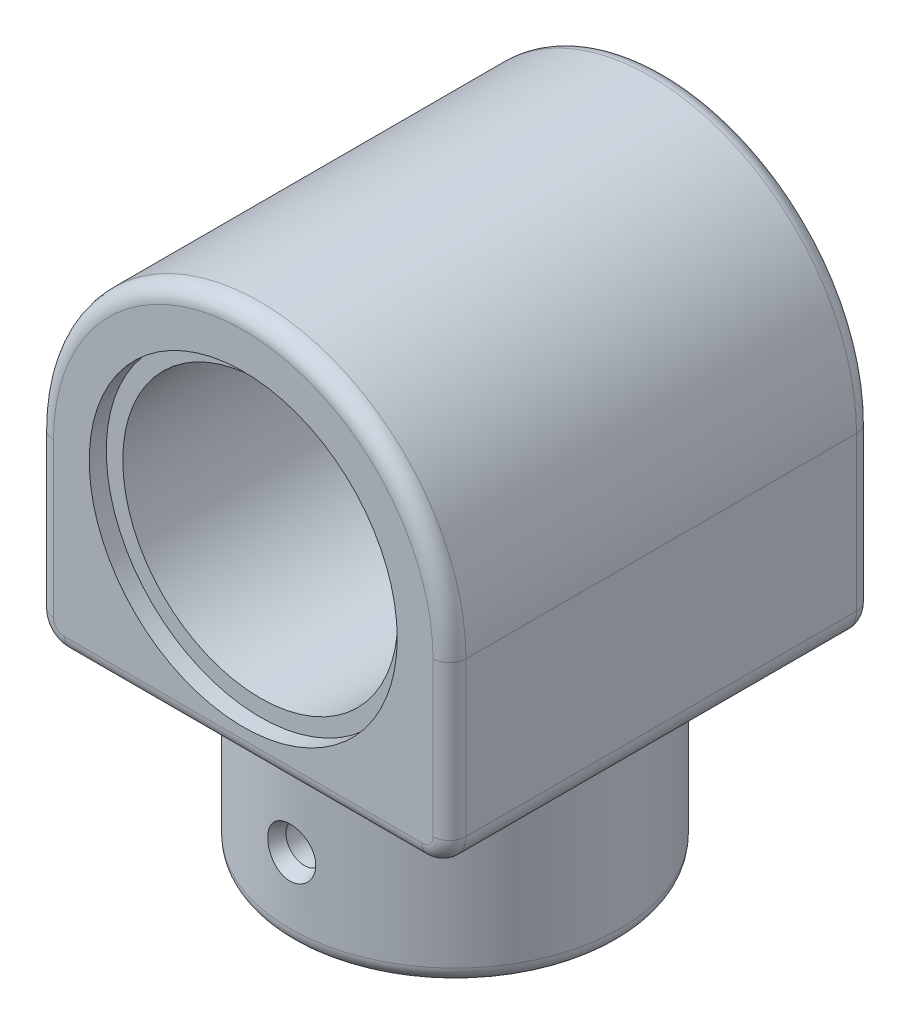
ISO-10303-21;
HEADER;
FILE_DESCRIPTION(('STEP AP214'),'2;1');
FILE_NAME('part.step','',(''),(''),'','','');
FILE_SCHEMA(('AUTOMOTIVE_DESIGN { 1 0 10303 214 1 1 1 1 }'));
ENDSEC;
DATA;
#1=APPLICATION_CONTEXT('core data for automotive mechanical design processes');
#2=APPLICATION_PROTOCOL_DEFINITION('international standard','automotive_design',2000,#1);
#3=PRODUCT_CONTEXT('',#1,'mechanical');
#4=PRODUCT('Part','Part','',(#3));
#5=PRODUCT_RELATED_PRODUCT_CATEGORY('part','',(#4));
#6=PRODUCT_DEFINITION_FORMATION('','',#4);
#7=PRODUCT_DEFINITION_CONTEXT('part definition',#1,'design');
#8=PRODUCT_DEFINITION('design','',#6,#7);
#9=PRODUCT_DEFINITION_SHAPE('','',#8);
#10=(LENGTH_UNIT() NAMED_UNIT(*) SI_UNIT(.MILLI.,.METRE.));
#11=(NAMED_UNIT(*) PLANE_ANGLE_UNIT() SI_UNIT($,.RADIAN.));
#12=(NAMED_UNIT(*) SI_UNIT($,.STERADIAN.) SOLID_ANGLE_UNIT());
#13=UNCERTAINTY_MEASURE_WITH_UNIT(LENGTH_MEASURE(1.E-05),#10,'distance_accuracy_value','');
#14=(GEOMETRIC_REPRESENTATION_CONTEXT(3) GLOBAL_UNCERTAINTY_ASSIGNED_CONTEXT((#13)) GLOBAL_UNIT_ASSIGNED_CONTEXT((#10,
#11,#12)) REPRESENTATION_CONTEXT('',''));
#15=CARTESIAN_POINT('',(0.,0.,0.));
#16=DIRECTION('',(0.,0.,1.));
#17=DIRECTION('',(1.,0.,0.));
#18=AXIS2_PLACEMENT_3D('',#15,#16,#17);
#19=CARTESIAN_POINT('',(0.,0.,-38.5));
#20=DIRECTION('',(0.,0.,1.));
#21=DIRECTION('',(1.,0.,0.));
#22=AXIS2_PLACEMENT_3D('',#19,#20,#21);
#23=PLANE('',#22);
#24=CARTESIAN_POINT('',(-18.1865334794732,10.5000000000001,-38.5));
#25=DIRECTION('',(0.,0.,-1.));
#26=DIRECTION('',(-1.,0.,0.));
#27=AXIS2_PLACEMENT_3D('',#24,#25,#26);
#28=CIRCLE('',#27,3.5);
#29=CARTESIAN_POINT('',(-21.6865334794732,10.5000000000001,-38.5));
#30=VERTEX_POINT('',#29);
#31=EDGE_CURVE('E303',#30,#30,#28,.T.);
#32=ORIENTED_EDGE('',*,*,#31,.F.);
#33=EDGE_LOOP('',(#32));
#34=FACE_BOUND('',#33,.T.);
#35=CARTESIAN_POINT('',(-32.5,-28.,-38.5));
#36=DIRECTION('',(0.,0.,1.));
#37=DIRECTION('',(1.,0.,0.));
#38=AXIS2_PLACEMENT_3D('',#35,#36,#37);
#39=CIRCLE('',#38,2.);
#40=CARTESIAN_POINT('',(-32.5,-30.,-38.5));
#41=VERTEX_POINT('',#40);
#42=CARTESIAN_POINT('',(-34.5,-28.,-38.5));
#43=VERTEX_POINT('',#42);
#44=EDGE_CURVE('E65',#41,#43,#39,.F.);
#45=ORIENTED_EDGE('',*,*,#44,.T.);
#46=DIRECTION('',(0.,-1.,0.));
#47=VECTOR('',#46,1.);
#48=CARTESIAN_POINT('',(-34.5,0.,-38.5));
#49=LINE('',#48,#47);
#50=CARTESIAN_POINT('',(-34.5,0.,-38.5));
#51=VERTEX_POINT('',#50);
#52=EDGE_CURVE('E162',#43,#51,#49,.F.);
#53=ORIENTED_EDGE('',*,*,#52,.T.);
#54=CARTESIAN_POINT('',(0.,0.,-38.5));
#55=DIRECTION('',(0.,0.,1.));
#56=DIRECTION('',(1.,0.,0.));
#57=AXIS2_PLACEMENT_3D('',#54,#55,#56);
#58=CIRCLE('',#57,34.5);
#59=CARTESIAN_POINT('',(34.5,0.,-38.5));
#60=VERTEX_POINT('',#59);
#61=EDGE_CURVE('E223',#51,#60,#58,.F.);
#62=ORIENTED_EDGE('',*,*,#61,.T.);
#63=DIRECTION('',(0.,1.,0.));
#64=VECTOR('',#63,1.);
#65=CARTESIAN_POINT('',(34.5,0.,-38.5));
#66=LINE('',#65,#64);
#67=CARTESIAN_POINT('',(34.5,-28.,-38.5));
#68=VERTEX_POINT('',#67);
#69=EDGE_CURVE('E225',#60,#68,#66,.F.);
#70=ORIENTED_EDGE('',*,*,#69,.T.);
#71=CARTESIAN_POINT('',(32.5,-28.,-38.5));
#72=DIRECTION('',(0.,0.,1.));
#73=DIRECTION('',(1.,0.,0.));
#74=AXIS2_PLACEMENT_3D('',#71,#72,#73);
#75=CIRCLE('',#74,2.);
#76=CARTESIAN_POINT('',(32.5,-30.,-38.5));
#77=VERTEX_POINT('',#76);
#78=EDGE_CURVE('E227',#68,#77,#75,.F.);
#79=ORIENTED_EDGE('',*,*,#78,.T.);
#80=DIRECTION('',(1.,0.,0.));
#81=VECTOR('',#80,1.);
#82=CARTESIAN_POINT('',(0.,-30.,-38.5));
#83=LINE('',#82,#81);
#84=EDGE_CURVE('E229',#77,#41,#83,.F.);
#85=ORIENTED_EDGE('',*,*,#84,.T.);
#86=EDGE_LOOP('',(#45,#53,#62,#70,#79,#85));
#87=FACE_BOUND('',#86,.T.);
#88=CARTESIAN_POINT('',(0.,0.,-38.5));
#89=DIRECTION('',(0.,0.,1.));
#90=DIRECTION('',(1.,0.,0.));
#91=AXIS2_PLACEMENT_3D('',#88,#89,#90);
#92=CIRCLE('',#91,13.5);
#93=CARTESIAN_POINT('',(13.5,0.,-38.5));
#94=VERTEX_POINT('',#93);
#95=EDGE_CURVE('E324',#94,#94,#92,.T.);
#96=ORIENTED_EDGE('',*,*,#95,.T.);
#97=EDGE_LOOP('',(#96));
#98=FACE_BOUND('',#97,.T.);
#99=CARTESIAN_POINT('',(0.,-21.,-38.5));
#100=DIRECTION('',(0.,0.,-1.));
#101=DIRECTION('',(-1.,0.,0.));
#102=AXIS2_PLACEMENT_3D('',#99,#100,#101);
#103=CIRCLE('',#102,3.5);
#104=CARTESIAN_POINT('',(-3.5,-21.,-38.5));
#105=VERTEX_POINT('',#104);
#106=EDGE_CURVE('E318',#105,#105,#103,.T.);
#107=ORIENTED_EDGE('',*,*,#106,.F.);
#108=EDGE_LOOP('',(#107));
#109=FACE_BOUND('',#108,.T.);
#110=CARTESIAN_POINT('',(18.1865334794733,10.4999999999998,-38.5));
#111=DIRECTION('',(0.,0.,-1.));
#112=DIRECTION('',(-1.,0.,0.));
#113=AXIS2_PLACEMENT_3D('',#110,#111,#112);
#114=CIRCLE('',#113,3.5);
#115=CARTESIAN_POINT('',(14.6865334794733,10.4999999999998,-38.5));
#116=VERTEX_POINT('',#115);
#117=EDGE_CURVE('E645',#116,#116,#114,.T.);
#118=ORIENTED_EDGE('',*,*,#117,.F.);
#119=EDGE_LOOP('',(#118));
#120=FACE_BOUND('',#119,.T.);
#121=ADVANCED_FACE('F40',(#34,#87,#98,#109,#120),#23,.F.);
#122=CARTESIAN_POINT('',(-32.5,-33.,38.5));
#123=DIRECTION('',(0.,1.,0.));
#124=DIRECTION('',(0.,0.,1.));
#125=AXIS2_PLACEMENT_3D('',#122,#123,#124);
#126=PLANE('',#125);
#127=DIRECTION('',(0.,0.,-1.));
#128=VECTOR('',#127,1.);
#129=CARTESIAN_POINT('',(32.5,-33.,38.5));
#130=LINE('',#129,#128);
#131=CARTESIAN_POINT('',(32.5,-33.,-5.72276157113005));
#132=VERTEX_POINT('',#131);
#133=CARTESIAN_POINT('',(32.5,-33.,-35.5));
#134=VERTEX_POINT('',#133);
#135=EDGE_CURVE('E482',#132,#134,#130,.T.);
#136=ORIENTED_EDGE('',*,*,#135,.F.);
#137=CARTESIAN_POINT('',(0.,-33.,0.));
#138=DIRECTION('',(0.,1.,0.));
#139=DIRECTION('',(0.,0.,1.));
#140=AXIS2_PLACEMENT_3D('',#137,#138,#139);
#141=CIRCLE('',#140,33.);
#142=CARTESIAN_POINT('',(-32.5,-33.,-5.72276157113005));
#143=VERTEX_POINT('',#142);
#144=EDGE_CURVE('E466',#132,#143,#141,.T.);
#145=ORIENTED_EDGE('',*,*,#144,.T.);
#146=DIRECTION('',(0.,0.,-1.));
#147=VECTOR('',#146,1.);
#148=CARTESIAN_POINT('',(-32.5,-33.,38.5));
#149=LINE('',#148,#147);
#150=CARTESIAN_POINT('',(-32.5,-33.,-35.5));
#151=VERTEX_POINT('',#150);
#152=EDGE_CURVE('E475',#143,#151,#149,.T.);
#153=ORIENTED_EDGE('',*,*,#152,.T.);
#154=DIRECTION('',(1.,0.,0.));
#155=VECTOR('',#154,1.);
#156=CARTESIAN_POINT('',(-32.5,-33.,-35.5));
#157=LINE('',#156,#155);
#158=EDGE_CURVE('E458',#151,#134,#157,.T.);
#159=ORIENTED_EDGE('',*,*,#158,.T.);
#160=EDGE_LOOP('',(#136,#145,#153,#159));
#161=FACE_BOUND('',#160,.T.);
#162=ADVANCED_FACE('F293',(#161),#126,.F.);
#163=CARTESIAN_POINT('',(32.5,-33.,35.5));
#164=VERTEX_POINT('',#163);
#165=CARTESIAN_POINT('',(32.5,-33.,5.72276157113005));
#166=VERTEX_POINT('',#165);
#167=EDGE_CURVE('E479',#164,#166,#130,.T.);
#168=ORIENTED_EDGE('',*,*,#167,.F.);
#169=DIRECTION('',(1.,0.,0.));
#170=VECTOR('',#169,1.);
#171=CARTESIAN_POINT('',(-32.5,-33.,35.5));
#172=LINE('',#171,#170);
#173=CARTESIAN_POINT('',(-32.5,-33.,35.5));
#174=VERTEX_POINT('',#173);
#175=EDGE_CURVE('E469',#164,#174,#172,.F.);
#176=ORIENTED_EDGE('',*,*,#175,.T.);
#177=CARTESIAN_POINT('',(-32.5,-33.,5.72276157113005));
#178=VERTEX_POINT('',#177);
#179=EDGE_CURVE('E478',#174,#178,#149,.T.);
#180=ORIENTED_EDGE('',*,*,#179,.T.);
#181=CARTESIAN_POINT('',(0.,-33.,0.));
#182=DIRECTION('',(0.,1.,0.));
#183=DIRECTION('',(0.,0.,1.));
#184=AXIS2_PLACEMENT_3D('',#181,#182,#183);
#185=CIRCLE('',#184,33.);
#186=EDGE_CURVE('E463',#178,#166,#185,.T.);
#187=ORIENTED_EDGE('',*,*,#186,.T.);
#188=EDGE_LOOP('',(#168,#176,#180,#187));
#189=FACE_BOUND('',#188,.T.);
#190=ADVANCED_FACE('F298',(#189),#126,.F.);
#191=CARTESIAN_POINT('',(0.,0.,38.5));
#192=DIRECTION('',(0.,0.,-1.));
#193=DIRECTION('',(-1.,0.,0.));
#194=AXIS2_PLACEMENT_3D('',#191,#192,#193);
#195=CYLINDRICAL_SURFACE('',#194,37.5);
#196=DIRECTION('',(0.,0.,-1.));
#197=VECTOR('',#196,1.);
#198=CARTESIAN_POINT('',(-37.5,0.,38.5));
#199=LINE('',#198,#197);
#200=CARTESIAN_POINT('',(-37.5,0.,35.5));
#201=VERTEX_POINT('',#200);
#202=CARTESIAN_POINT('',(-37.5,0.,-35.5));
#203=VERTEX_POINT('',#202);
#204=EDGE_CURVE('E430',#201,#203,#199,.T.);
#205=ORIENTED_EDGE('',*,*,#204,.F.);
#206=CARTESIAN_POINT('',(0.,0.,35.5));
#207=DIRECTION('',(0.,0.,1.));
#208=DIRECTION('',(1.,0.,0.));
#209=AXIS2_PLACEMENT_3D('',#206,#207,#208);
#210=CIRCLE('',#209,37.5);
#211=CARTESIAN_POINT('',(37.5,0.,35.5));
#212=VERTEX_POINT('',#211);
#213=EDGE_CURVE('E177',#201,#212,#210,.F.);
#214=ORIENTED_EDGE('',*,*,#213,.T.);
#215=DIRECTION('',(0.,0.,-1.));
#216=VECTOR('',#215,1.);
#217=CARTESIAN_POINT('',(37.5,0.,38.5));
#218=LINE('',#217,#216);
#219=CARTESIAN_POINT('',(37.5,0.,-35.5));
#220=VERTEX_POINT('',#219);
#221=EDGE_CURVE('E433',#212,#220,#218,.T.);
#222=ORIENTED_EDGE('',*,*,#221,.T.);
#223=CARTESIAN_POINT('',(0.,0.,-35.5));
#224=DIRECTION('',(0.,0.,1.));
#225=DIRECTION('',(1.,0.,0.));
#226=AXIS2_PLACEMENT_3D('',#223,#224,#225);
#227=CIRCLE('',#226,37.5);
#228=EDGE_CURVE('E181',#220,#203,#227,.T.);
#229=ORIENTED_EDGE('',*,*,#228,.T.);
#230=EDGE_LOOP('',(#205,#214,#222,#229));
#231=FACE_BOUND('',#230,.T.);
#232=ADVANCED_FACE('F403',(#231),#195,.T.);
#233=CARTESIAN_POINT('',(-37.5,0.,38.5));
#234=DIRECTION('',(1.,0.,0.));
#235=DIRECTION('',(0.,1.,0.));
#236=AXIS2_PLACEMENT_3D('',#233,#234,#235);
#237=PLANE('',#236);
#238=DIRECTION('',(0.,0.,-1.));
#239=VECTOR('',#238,1.);
#240=CARTESIAN_POINT('',(-37.5,-28.,38.5));
#241=LINE('',#240,#239);
#242=CARTESIAN_POINT('',(-37.5,-28.,35.5));
#243=VERTEX_POINT('',#242);
#244=CARTESIAN_POINT('',(-37.5,-28.,-35.5));
#245=VERTEX_POINT('',#244);
#246=EDGE_CURVE('E441',#243,#245,#241,.T.);
#247=ORIENTED_EDGE('',*,*,#246,.F.);
#248=DIRECTION('',(0.,-1.,0.));
#249=VECTOR('',#248,1.);
#250=CARTESIAN_POINT('',(-37.5,0.,35.5));
#251=LINE('',#250,#249);
#252=EDGE_CURVE('E424',#243,#201,#251,.F.);
#253=ORIENTED_EDGE('',*,*,#252,.T.);
#254=ORIENTED_EDGE('',*,*,#204,.T.);
#255=DIRECTION('',(0.,-1.,0.));
#256=VECTOR('',#255,1.);
#257=CARTESIAN_POINT('',(-37.5,0.,-35.5));
#258=LINE('',#257,#256);
#259=EDGE_CURVE('E422',#203,#245,#258,.T.);
#260=ORIENTED_EDGE('',*,*,#259,.T.);
#261=EDGE_LOOP('',(#247,#253,#254,#260));
#262=FACE_BOUND('',#261,.T.);
#263=ADVANCED_FACE('F408',(#262),#237,.F.);
#264=CARTESIAN_POINT('',(-32.5,-28.,38.5));
#265=DIRECTION('',(0.,0.,-1.));
#266=DIRECTION('',(-1.,0.,0.));
#267=AXIS2_PLACEMENT_3D('',#264,#265,#266);
#268=CYLINDRICAL_SURFACE('',#267,5.);
#269=ORIENTED_EDGE('',*,*,#179,.F.);
#270=CARTESIAN_POINT('',(-32.5,-28.,35.5));
#271=DIRECTION('',(0.,0.,1.));
#272=DIRECTION('',(1.,0.,0.));
#273=AXIS2_PLACEMENT_3D('',#270,#271,#272);
#274=CIRCLE('',#273,5.);
#275=EDGE_CURVE('E418',#174,#243,#274,.F.);
#276=ORIENTED_EDGE('',*,*,#275,.T.);
#277=ORIENTED_EDGE('',*,*,#246,.T.);
#278=CARTESIAN_POINT('',(-32.5,-28.,-35.5));
#279=DIRECTION('',(0.,0.,1.));
#280=DIRECTION('',(1.,0.,0.));
#281=AXIS2_PLACEMENT_3D('',#278,#279,#280);
#282=CIRCLE('',#281,5.);
#283=EDGE_CURVE('E245',#245,#151,#282,.T.);
#284=ORIENTED_EDGE('',*,*,#283,.T.);
#285=ORIENTED_EDGE('',*,*,#152,.F.);
#286=CARTESIAN_POINT('',(-31.0269999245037,-32.7781032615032,-13.4308414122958));
#287=CARTESIAN_POINT('',(-27.6032051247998,-31.7226112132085,-11.7603257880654));
#288=CARTESIAN_POINT('',(-27.4029089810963,-35.6449652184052,-12.2098558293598));
#289=CARTESIAN_POINT('',(-31.1121655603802,-32.8043348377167,-13.1250414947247));
#290=CARTESIAN_POINT('',(-27.7015173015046,-31.8191347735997,-11.5276477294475));
#291=CARTESIAN_POINT('',(-27.5267862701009,-35.6869357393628,-11.9318559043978));
#292=CARTESIAN_POINT('',(-31.1945679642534,-32.8272685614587,-12.8166006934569));
#293=CARTESIAN_POINT('',(-27.8004997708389,-31.9094802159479,-11.2855429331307));
#294=CARTESIAN_POINT('',(-27.6466443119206,-35.7236296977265,-11.6514551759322));
#295=CARTESIAN_POINT('',(-31.3536311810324,-32.8675069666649,-12.1951081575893));
#296=CARTESIAN_POINT('',(-27.9956868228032,-32.0766671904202,-10.7894789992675));
#297=CARTESIAN_POINT('',(-27.8780089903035,-35.7880111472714,-11.0864619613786));
#298=CARTESIAN_POINT('',(-31.430293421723,-32.8848130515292,-11.8820575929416));
#299=CARTESIAN_POINT('',(-28.0920627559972,-32.1538529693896,-10.535420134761));
#300=CARTESIAN_POINT('',(-27.9895177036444,-35.8157008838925,-10.8018705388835));
#301=CARTESIAN_POINT('',(-31.5776162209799,-32.91475714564,-11.252237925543));
#302=CARTESIAN_POINT('',(-28.2802828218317,-32.2959814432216,-10.0175468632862));
#303=CARTESIAN_POINT('',(-28.203805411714,-35.863611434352,-10.2293072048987));
#304=CARTESIAN_POINT('',(-31.6482838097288,-32.9274006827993,-10.9354736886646));
#305=CARTESIAN_POINT('',(-28.3723196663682,-32.3612195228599,-9.75357980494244));
#306=CARTESIAN_POINT('',(-28.3065946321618,-35.8838410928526,-9.94133971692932));
#307=CARTESIAN_POINT('',(-31.7835927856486,-32.948883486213,-10.2983342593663));
#308=CARTESIAN_POINT('',(-28.5507615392,-32.4809598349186,-9.21717256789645));
#309=CARTESIAN_POINT('',(-28.5034076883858,-35.9182135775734,-9.36212205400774));
#310=CARTESIAN_POINT('',(-31.8482337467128,-32.9577224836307,-9.97795881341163));
#311=CARTESIAN_POINT('',(-28.637359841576,-32.5356903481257,-8.94451139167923));
#312=CARTESIAN_POINT('',(-28.5974309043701,-35.9323559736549,-9.07087164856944));
#313=CARTESIAN_POINT('',(-32.0330805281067,-32.9797052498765,-9.01142082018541));
#314=CARTESIAN_POINT('',(-28.8857564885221,-32.6848389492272,-8.12050905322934));
#315=CARTESIAN_POINT('',(-28.866298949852,-35.9675284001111,-8.19220074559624));
#316=CARTESIAN_POINT('',(-32.1440754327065,-32.9882903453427,-8.36042277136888));
#317=CARTESIAN_POINT('',(-29.0402981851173,-32.7670838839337,-7.55145749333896));
#318=CARTESIAN_POINT('',(-29.0277460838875,-35.9812645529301,-7.6003843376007));
#319=CARTESIAN_POINT('',(-32.3409712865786,-32.9984420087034,-7.04838736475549));
#320=CARTESIAN_POINT('',(-29.3165684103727,-32.9024516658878,-6.39422530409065));
#321=CARTESIAN_POINT('',(-29.3141400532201,-35.9975072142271,-6.40762487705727));
#322=CARTESIAN_POINT('',(-32.4268599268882,-33.0000051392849,-6.38734524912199));
#323=CARTESIAN_POINT('',(-29.4396147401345,-32.956468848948,-5.80350920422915));
#324=CARTESIAN_POINT('',(-29.4390689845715,-36.0000082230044,-5.80667749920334));
#325=CARTESIAN_POINT('',(-32.5519484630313,-32.9999963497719,-5.25073441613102));
#326=CARTESIAN_POINT('',(-29.6197069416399,-33.0305394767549,-4.78087716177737));
#327=CARTESIAN_POINT('',(-29.6210159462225,-35.9999941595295,-4.77339492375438));
#328=CARTESIAN_POINT('',(-32.5974656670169,-32.9992015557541,-4.77692065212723));
#329=CARTESIAN_POINT('',(-29.6857316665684,-33.0560182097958,-4.35285018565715));
#330=CARTESIAN_POINT('',(-29.6872227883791,-35.9987224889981,-4.34265513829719));
#331=CARTESIAN_POINT('',(-32.6755619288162,-32.997070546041,-3.82653372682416));
#332=CARTESIAN_POINT('',(-29.7991677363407,-33.0981729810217,-3.4923513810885));
#333=CARTESIAN_POINT('',(-29.8008173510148,-35.9953128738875,-3.47866702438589));
#334=CARTESIAN_POINT('',(-32.708140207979,-32.9957342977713,-3.34996040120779));
#335=CARTESIAN_POINT('',(-29.8468599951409,-33.1149675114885,-3.05883763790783));
#336=CARTESIAN_POINT('',(-29.8482039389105,-35.9931748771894,-3.0454185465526));
#337=CARTESIAN_POINT('',(-32.7602942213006,-32.9932881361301,-2.39494132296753));
#338=CARTESIAN_POINT('',(-29.9231821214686,-33.1412057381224,-2.18926831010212));
#339=CARTESIAN_POINT('',(-29.9240643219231,-35.9892610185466,-2.17721938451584));
#340=CARTESIAN_POINT('',(-32.7798684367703,-32.9921782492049,-1.91649535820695));
#341=CARTESIAN_POINT('',(-29.9520002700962,-33.1507180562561,-1.75214046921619));
#342=CARTESIAN_POINT('',(-29.9525359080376,-35.9874851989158,-1.74226850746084));
#343=CARTESIAN_POINT('',(-32.8059711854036,-32.9906465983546,-0.958699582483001));
#344=CARTESIAN_POINT('',(-29.9903610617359,-33.1632744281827,-0.877218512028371));
#345=CARTESIAN_POINT('',(-29.9905035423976,-35.9850345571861,-0.871545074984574));
#346=CARTESIAN_POINT('',(-32.8125,-32.9902248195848,-0.4793497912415));
#347=CARTESIAN_POINT('',(-30.,-33.1663504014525,-0.438335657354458));
#348=CARTESIAN_POINT('',(-30.,-35.9843597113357,-0.435772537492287));
#349=CARTESIAN_POINT('',(-32.8125,-32.9902248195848,0.479349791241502));
#350=CARTESIAN_POINT('',(-30.,-33.1663504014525,0.43833565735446));
#351=CARTESIAN_POINT('',(-30.,-35.9843597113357,0.435772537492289));
#352=CARTESIAN_POINT('',(-32.8059711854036,-32.9906465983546,0.958699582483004));
#353=CARTESIAN_POINT('',(-29.9903610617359,-33.1632744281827,0.877218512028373));
#354=CARTESIAN_POINT('',(-29.9905035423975,-35.9850345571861,0.871545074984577));
#355=CARTESIAN_POINT('',(-32.7798684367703,-32.9921782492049,1.91649535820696));
#356=CARTESIAN_POINT('',(-29.9520002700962,-33.1507180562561,1.75214046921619));
#357=CARTESIAN_POINT('',(-29.9525359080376,-35.9874851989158,1.74226850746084));
#358=CARTESIAN_POINT('',(-32.7602942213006,-32.9932881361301,2.39494132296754));
#359=CARTESIAN_POINT('',(-29.9231821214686,-33.1412057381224,2.18926831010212));
#360=CARTESIAN_POINT('',(-29.9240643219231,-35.9892610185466,2.17721938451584));
#361=CARTESIAN_POINT('',(-32.708140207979,-32.9957342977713,3.34996040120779));
#362=CARTESIAN_POINT('',(-29.8468599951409,-33.1149675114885,3.05883763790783));
#363=CARTESIAN_POINT('',(-29.8482039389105,-35.9931748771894,3.0454185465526));
#364=CARTESIAN_POINT('',(-32.6755619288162,-32.997070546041,3.82653372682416));
#365=CARTESIAN_POINT('',(-29.7991677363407,-33.0981729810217,3.4923513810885));
#366=CARTESIAN_POINT('',(-29.8008173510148,-35.9953128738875,3.47866702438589));
#367=CARTESIAN_POINT('',(-32.5974656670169,-32.9992015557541,4.77692065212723));
#368=CARTESIAN_POINT('',(-29.6857316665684,-33.0560182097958,4.35285018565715));
#369=CARTESIAN_POINT('',(-29.6872227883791,-35.9987224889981,4.34265513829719));
#370=CARTESIAN_POINT('',(-32.5519484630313,-32.9999963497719,5.25073441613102));
#371=CARTESIAN_POINT('',(-29.6197069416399,-33.0305394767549,4.78087716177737));
#372=CARTESIAN_POINT('',(-29.6210159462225,-35.9999941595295,4.77339492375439));
#373=CARTESIAN_POINT('',(-32.4268599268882,-33.0000051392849,6.38734524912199));
#374=CARTESIAN_POINT('',(-29.4396147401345,-32.956468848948,5.80350920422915));
#375=CARTESIAN_POINT('',(-29.4390689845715,-36.0000082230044,5.80667749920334));
#376=CARTESIAN_POINT('',(-32.3409712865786,-32.9984420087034,7.04838736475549));
#377=CARTESIAN_POINT('',(-29.3165684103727,-32.9024516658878,6.39422530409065));
#378=CARTESIAN_POINT('',(-29.3141400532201,-35.9975072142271,6.40762487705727));
#379=CARTESIAN_POINT('',(-32.1440754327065,-32.9882903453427,8.36042277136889));
#380=CARTESIAN_POINT('',(-29.0402981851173,-32.7670838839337,7.55145749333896));
#381=CARTESIAN_POINT('',(-29.0277460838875,-35.9812645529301,7.6003843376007));
#382=CARTESIAN_POINT('',(-32.0330805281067,-32.9797052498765,9.01142082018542));
#383=CARTESIAN_POINT('',(-28.8857564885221,-32.6848389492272,8.12050905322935));
#384=CARTESIAN_POINT('',(-28.866298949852,-35.9675284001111,8.19220074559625));
#385=CARTESIAN_POINT('',(-31.8482337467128,-32.9577224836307,9.97795881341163));
#386=CARTESIAN_POINT('',(-28.637359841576,-32.5356903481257,8.94451139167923));
#387=CARTESIAN_POINT('',(-28.5974309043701,-35.9323559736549,9.07087164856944));
#388=CARTESIAN_POINT('',(-31.7835927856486,-32.948883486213,10.2983342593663));
#389=CARTESIAN_POINT('',(-28.5507615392,-32.4809598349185,9.21717256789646));
#390=CARTESIAN_POINT('',(-28.5034076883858,-35.9182135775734,9.36212205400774));
#391=CARTESIAN_POINT('',(-31.6482838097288,-32.9274006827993,10.9354736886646));
#392=CARTESIAN_POINT('',(-28.3723196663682,-32.3612195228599,9.75357980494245));
#393=CARTESIAN_POINT('',(-28.3065946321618,-35.8838410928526,9.94133971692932));
#394=CARTESIAN_POINT('',(-31.5776162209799,-32.91475714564,11.252237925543));
#395=CARTESIAN_POINT('',(-28.2802828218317,-32.2959814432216,10.0175468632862));
#396=CARTESIAN_POINT('',(-28.203805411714,-35.863611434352,10.2293072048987));
#397=CARTESIAN_POINT('',(-31.430293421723,-32.8848130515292,11.8820575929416));
#398=CARTESIAN_POINT('',(-28.0920627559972,-32.1538529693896,10.535420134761));
#399=CARTESIAN_POINT('',(-27.9895177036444,-35.8157008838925,10.8018705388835));
#400=CARTESIAN_POINT('',(-31.3536311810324,-32.8675069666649,12.1951081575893));
#401=CARTESIAN_POINT('',(-27.9956868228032,-32.0766671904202,10.7894789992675));
#402=CARTESIAN_POINT('',(-27.8780089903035,-35.7880111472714,11.0864619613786));
#403=CARTESIAN_POINT('',(-31.1945679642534,-32.8272685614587,12.8166006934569));
#404=CARTESIAN_POINT('',(-27.8004997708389,-31.9094802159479,11.2855429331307));
#405=CARTESIAN_POINT('',(-27.6466443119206,-35.7236296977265,11.6514551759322));
#406=CARTESIAN_POINT('',(-31.1121655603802,-32.8043348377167,13.1250414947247));
#407=CARTESIAN_POINT('',(-27.7015173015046,-31.8191347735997,11.5276477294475));
#408=CARTESIAN_POINT('',(-27.5267862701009,-35.6869357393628,11.9318559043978));
#409=CARTESIAN_POINT('',(-31.0269999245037,-32.7781032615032,13.4308414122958));
#410=CARTESIAN_POINT('',(-27.6032051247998,-31.7226112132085,11.7603257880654));
#411=CARTESIAN_POINT('',(-27.4029089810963,-35.6449652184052,12.2098558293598));
#412=(BOUNDED_SURFACE() B_SPLINE_SURFACE(3,2,((#286,#287,#288),(#289,#290,#291),(#292,#293,
#294),(#295,#296,#297),(#298,#299,#300),(#301,#302,#303),(#304,#305,#306),(#307,#308,#309),
(#310,#311,#312),(#313,#314,#315),(#316,#317,#318),(#319,#320,#321),(#322,#323,#324),(#325,#326,
#327),(#328,#329,#330),(#331,#332,#333),(#334,#335,#336),(#337,#338,#339),(#340,#341,#342),
(#343,#344,#345),(#346,#347,#348),(#349,#350,#351),(#352,#353,#354),(#355,#356,#357),(#358,#359,
#360),(#361,#362,#363),(#364,#365,#366),(#367,#368,#369),(#370,#371,#372),(#373,#374,#375),
(#376,#377,#378),(#379,#380,#381),(#382,#383,#384),(#385,#386,#387),(#388,#389,#390),(#391,#392,
#393),(#394,#395,#396),(#397,#398,#399),(#400,#401,#402),(#403,#404,#405),(#406,#407,#408),
(#409,#410,#411)),.UNSPECIFIED.,.F.,.F.,.F.) B_SPLINE_SURFACE_WITH_KNOTS((4,2,2,2,2,2,2,2,2,2,2,
2,2,2,2,2,2,2,2,2,4),(3,3),(0.,1.01206920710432,2.02388583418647,3.03449896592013,
4.04518349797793,6.068397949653,8.09260267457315,9.53031417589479,10.968112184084,
12.4060780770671,13.8440129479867,15.2819478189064,16.7199137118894,18.1577117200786,
19.5954232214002,21.6196279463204,23.6428423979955,24.6535269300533,25.6641400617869,
26.6759566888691,27.6880258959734),(0.,1.),
.UNSPECIFIED.) GEOMETRIC_REPRESENTATION_ITEM() RATIONAL_B_SPLINE_SURFACE(((1.,0.604526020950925,
1.),(1.,0.610457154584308,1.),(1.,0.61619582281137,1.),(1.,0.627273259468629,1.),(1.,
0.632612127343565,1.),(1.,0.642871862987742,1.),(1.,0.647793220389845,1.),(1.,0.657216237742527,
1.),(1.,0.661717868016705,1.),(1.,0.674590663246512,1.),(1.,0.682320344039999,1.),(1.,
0.69603211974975,1.),(1.,0.702013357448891,1.),(1.,0.710724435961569,1.),(1.,0.713894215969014,
1.),(1.,0.719332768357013,1.),(1.,0.721601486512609,1.),(1.,0.725233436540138,1.),(1.,
0.72659656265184,1.),(1.,0.728414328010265,1.),(1.,0.728868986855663,1.),(1.,0.728868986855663,
1.),(1.,0.728414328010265,1.),(1.,0.72659656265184,1.),(1.,0.725233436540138,1.),(1.,
0.721601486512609,1.),(1.,0.719332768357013,1.),(1.,0.713894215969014,1.),(1.,0.710724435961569,
1.),(1.,0.702013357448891,1.),(1.,0.69603211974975,1.),(1.,0.682320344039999,1.),(1.,
0.674590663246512,1.),(1.,0.661717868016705,1.),(1.,0.657216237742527,1.),(1.,0.647793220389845,
1.),(1.,0.642871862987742,1.),(1.,0.632612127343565,1.),(1.,0.627273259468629,1.),(1.,
0.61619582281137,1.),(1.,0.610457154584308,1.),(1.,0.604526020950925,1.))) REPRESENTATION_ITEM('') SURFACE());
#413=CARTESIAN_POINT('',(-31.0269999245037,-32.7781032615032,-13.4308414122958));
#414=CARTESIAN_POINT('',(-31.1121655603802,-32.8043348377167,-13.1250414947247));
#415=CARTESIAN_POINT('',(-31.1945679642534,-32.8272685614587,-12.8166006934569));
#416=CARTESIAN_POINT('',(-31.3536311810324,-32.8675069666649,-12.1951081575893));
#417=CARTESIAN_POINT('',(-31.430293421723,-32.8848130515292,-11.8820575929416));
#418=CARTESIAN_POINT('',(-31.5776162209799,-32.91475714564,-11.252237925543));
#419=CARTESIAN_POINT('',(-31.6482838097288,-32.9274006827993,-10.9354736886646));
#420=CARTESIAN_POINT('',(-31.7835927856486,-32.948883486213,-10.2983342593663));
#421=CARTESIAN_POINT('',(-31.8482337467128,-32.9577224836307,-9.97795881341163));
#422=CARTESIAN_POINT('',(-32.0330805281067,-32.9797052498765,-9.01142082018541));
#423=CARTESIAN_POINT('',(-32.1440754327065,-32.9882903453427,-8.36042277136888));
#424=CARTESIAN_POINT('',(-32.3409712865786,-32.9984420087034,-7.04838736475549));
#425=CARTESIAN_POINT('',(-32.4268599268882,-33.0000051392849,-6.38734524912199));
#426=CARTESIAN_POINT('',(-32.5519484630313,-32.9999963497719,-5.25073441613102));
#427=CARTESIAN_POINT('',(-32.5974656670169,-32.9992015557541,-4.77692065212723));
#428=CARTESIAN_POINT('',(-32.6755619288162,-32.997070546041,-3.82653372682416));
#429=CARTESIAN_POINT('',(-32.708140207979,-32.9957342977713,-3.34996040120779));
#430=CARTESIAN_POINT('',(-32.7602942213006,-32.9932881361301,-2.39494132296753));
#431=CARTESIAN_POINT('',(-32.7798684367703,-32.9921782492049,-1.91649535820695));
#432=CARTESIAN_POINT('',(-32.8059711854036,-32.9906465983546,-0.958699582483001));
#433=CARTESIAN_POINT('',(-32.8125,-32.9902248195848,-0.479349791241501));
#434=CARTESIAN_POINT('',(-32.8125,-32.9902248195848,0.479349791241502));
#435=CARTESIAN_POINT('',(-32.8059711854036,-32.9906465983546,0.958699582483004));
#436=CARTESIAN_POINT('',(-32.7798684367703,-32.9921782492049,1.91649535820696));
#437=CARTESIAN_POINT('',(-32.7602942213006,-32.9932881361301,2.39494132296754));
#438=CARTESIAN_POINT('',(-32.708140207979,-32.9957342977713,3.34996040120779));
#439=CARTESIAN_POINT('',(-32.6755619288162,-32.997070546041,3.82653372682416));
#440=CARTESIAN_POINT('',(-32.5974656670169,-32.9992015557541,4.77692065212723));
#441=CARTESIAN_POINT('',(-32.5519484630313,-32.9999963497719,5.25073441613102));
#442=CARTESIAN_POINT('',(-32.4268599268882,-33.0000051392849,6.38734524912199));
#443=CARTESIAN_POINT('',(-32.3409712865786,-32.9984420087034,7.04838736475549));
#444=CARTESIAN_POINT('',(-32.1440754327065,-32.9882903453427,8.36042277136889));
#445=CARTESIAN_POINT('',(-32.0330805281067,-32.9797052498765,9.01142082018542));
#446=CARTESIAN_POINT('',(-31.8482337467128,-32.9577224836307,9.97795881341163));
#447=CARTESIAN_POINT('',(-31.7835927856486,-32.948883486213,10.2983342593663));
#448=CARTESIAN_POINT('',(-31.6482838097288,-32.9274006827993,10.9354736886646));
#449=CARTESIAN_POINT('',(-31.5776162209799,-32.91475714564,11.252237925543));
#450=CARTESIAN_POINT('',(-31.430293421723,-32.8848130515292,11.8820575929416));
#451=CARTESIAN_POINT('',(-31.3536311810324,-32.8675069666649,12.1951081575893));
#452=CARTESIAN_POINT('',(-31.1945679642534,-32.8272685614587,12.8166006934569));
#453=CARTESIAN_POINT('',(-31.1121655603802,-32.8043348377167,13.1250414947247));
#454=CARTESIAN_POINT('',(-31.0269999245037,-32.7781032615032,13.4308414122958));
#455=B_SPLINE_CURVE_WITH_KNOTS('',3,(#413,#414,#415,#416,#417,#418,#419,#420,#421,#422,#423,
#424,#425,#426,#427,#428,#429,#430,#431,#432,#433,#434,#435,#436,#437,#438,#439,#440,#441,#442,
#443,#444,#445,#446,#447,#448,#449,#450,#451,#452,#453,#454),.UNSPECIFIED.,.F.,.F.,(4,2,2,2,2,2,
2,2,2,2,2,2,2,2,2,2,2,2,2,2,4),(0.,1.01206920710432,2.02388583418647,3.03449896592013,
4.04518349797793,6.068397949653,8.09260267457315,9.53031417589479,10.968112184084,
12.4060780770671,13.8440129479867,15.2819478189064,16.7199137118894,18.1577117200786,
19.5954232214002,21.6196279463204,23.6428423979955,24.6535269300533,25.6641400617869,
26.6759566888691,27.6880258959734),.UNSPECIFIED.);
#456=EDGE_CURVE('E412',#143,#178,#455,.T.);
#457=ORIENTED_EDGE('',*,*,#456,.T.);
#458=EDGE_LOOP('',(#269,#276,#277,#284,#285,#457));
#459=FACE_BOUND('',#458,.T.);
#460=ADVANCED_FACE('F399',(#459),#268,.T.);
#461=CARTESIAN_POINT('',(32.5,-28.,38.5));
#462=DIRECTION('',(0.,0.,-1.));
#463=DIRECTION('',(-1.,0.,0.));
#464=AXIS2_PLACEMENT_3D('',#461,#462,#463);
#465=CYLINDRICAL_SURFACE('',#464,5.);
#466=DIRECTION('',(0.,0.,-1.));
#467=VECTOR('',#466,1.);
#468=CARTESIAN_POINT('',(37.5,-28.,38.5));
#469=LINE('',#468,#467);
#470=CARTESIAN_POINT('',(37.5,-28.,35.5));
#471=VERTEX_POINT('',#470);
#472=CARTESIAN_POINT('',(37.5,-28.,-35.5));
#473=VERTEX_POINT('',#472);
#474=EDGE_CURVE('E511',#471,#473,#469,.T.);
#475=ORIENTED_EDGE('',*,*,#474,.F.);
#476=CARTESIAN_POINT('',(32.5,-28.,35.5));
#477=DIRECTION('',(0.,0.,1.));
#478=DIRECTION('',(1.,0.,0.));
#479=AXIS2_PLACEMENT_3D('',#476,#477,#478);
#480=CIRCLE('',#479,5.);
#481=EDGE_CURVE('E367',#471,#164,#480,.F.);
#482=ORIENTED_EDGE('',*,*,#481,.T.);
#483=ORIENTED_EDGE('',*,*,#167,.T.);
#484=CARTESIAN_POINT('',(31.0269999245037,-32.7781032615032,13.4308414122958));
#485=CARTESIAN_POINT('',(27.6032051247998,-31.7226112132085,11.7603257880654));
#486=CARTESIAN_POINT('',(27.4029089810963,-35.6449652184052,12.2098558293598));
#487=CARTESIAN_POINT('',(31.1121655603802,-32.8043348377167,13.1250414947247));
#488=CARTESIAN_POINT('',(27.7015173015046,-31.8191347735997,11.5276477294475));
#489=CARTESIAN_POINT('',(27.5267862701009,-35.6869357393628,11.9318559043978));
#490=CARTESIAN_POINT('',(31.1945679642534,-32.8272685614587,12.8166006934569));
#491=CARTESIAN_POINT('',(27.8004997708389,-31.9094802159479,11.2855429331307));
#492=CARTESIAN_POINT('',(27.6466443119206,-35.7236296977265,11.6514551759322));
#493=CARTESIAN_POINT('',(31.3536311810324,-32.8675069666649,12.1951081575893));
#494=CARTESIAN_POINT('',(27.9956868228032,-32.0766671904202,10.7894789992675));
#495=CARTESIAN_POINT('',(27.8780089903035,-35.7880111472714,11.0864619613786));
#496=CARTESIAN_POINT('',(31.430293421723,-32.8848130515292,11.8820575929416));
#497=CARTESIAN_POINT('',(28.0920627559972,-32.1538529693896,10.535420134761));
#498=CARTESIAN_POINT('',(27.9895177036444,-35.8157008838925,10.8018705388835));
#499=CARTESIAN_POINT('',(31.5776162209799,-32.91475714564,11.252237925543));
#500=CARTESIAN_POINT('',(28.2802828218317,-32.2959814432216,10.0175468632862));
#501=CARTESIAN_POINT('',(28.203805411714,-35.863611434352,10.2293072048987));
#502=CARTESIAN_POINT('',(31.6482838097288,-32.9274006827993,10.9354736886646));
#503=CARTESIAN_POINT('',(28.3723196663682,-32.3612195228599,9.75357980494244));
#504=CARTESIAN_POINT('',(28.3065946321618,-35.8838410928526,9.94133971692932));
#505=CARTESIAN_POINT('',(31.7835927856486,-32.948883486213,10.2983342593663));
#506=CARTESIAN_POINT('',(28.5507615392,-32.4809598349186,9.21717256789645));
#507=CARTESIAN_POINT('',(28.5034076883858,-35.9182135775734,9.36212205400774));
#508=CARTESIAN_POINT('',(31.8482337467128,-32.9577224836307,9.97795881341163));
#509=CARTESIAN_POINT('',(28.637359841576,-32.5356903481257,8.94451139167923));
#510=CARTESIAN_POINT('',(28.5974309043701,-35.9323559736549,9.07087164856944));
#511=CARTESIAN_POINT('',(32.0330805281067,-32.9797052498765,9.01142082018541));
#512=CARTESIAN_POINT('',(28.8857564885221,-32.6848389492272,8.12050905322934));
#513=CARTESIAN_POINT('',(28.866298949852,-35.9675284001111,8.19220074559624));
#514=CARTESIAN_POINT('',(32.1440754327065,-32.9882903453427,8.36042277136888));
#515=CARTESIAN_POINT('',(29.0402981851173,-32.7670838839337,7.55145749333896));
#516=CARTESIAN_POINT('',(29.0277460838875,-35.9812645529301,7.6003843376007));
#517=CARTESIAN_POINT('',(32.3409712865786,-32.9984420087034,7.04838736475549));
#518=CARTESIAN_POINT('',(29.3165684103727,-32.9024516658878,6.39422530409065));
#519=CARTESIAN_POINT('',(29.3141400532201,-35.9975072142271,6.40762487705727));
#520=CARTESIAN_POINT('',(32.4268599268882,-33.0000051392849,6.38734524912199));
#521=CARTESIAN_POINT('',(29.4396147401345,-32.956468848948,5.80350920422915));
#522=CARTESIAN_POINT('',(29.4390689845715,-36.0000082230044,5.80667749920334));
#523=CARTESIAN_POINT('',(32.5519484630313,-32.9999963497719,5.25073441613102));
#524=CARTESIAN_POINT('',(29.6197069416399,-33.0305394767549,4.78087716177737));
#525=CARTESIAN_POINT('',(29.6210159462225,-35.9999941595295,4.77339492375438));
#526=CARTESIAN_POINT('',(32.5974656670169,-32.9992015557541,4.77692065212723));
#527=CARTESIAN_POINT('',(29.6857316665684,-33.0560182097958,4.35285018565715));
#528=CARTESIAN_POINT('',(29.6872227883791,-35.9987224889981,4.34265513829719));
#529=CARTESIAN_POINT('',(32.6755619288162,-32.997070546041,3.82653372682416));
#530=CARTESIAN_POINT('',(29.7991677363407,-33.0981729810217,3.4923513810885));
#531=CARTESIAN_POINT('',(29.8008173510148,-35.9953128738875,3.47866702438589));
#532=CARTESIAN_POINT('',(32.708140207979,-32.9957342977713,3.34996040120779));
#533=CARTESIAN_POINT('',(29.8468599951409,-33.1149675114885,3.05883763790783));
#534=CARTESIAN_POINT('',(29.8482039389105,-35.9931748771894,3.0454185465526));
#535=CARTESIAN_POINT('',(32.7602942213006,-32.9932881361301,2.39494132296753));
#536=CARTESIAN_POINT('',(29.9231821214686,-33.1412057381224,2.18926831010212));
#537=CARTESIAN_POINT('',(29.9240643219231,-35.9892610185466,2.17721938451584));
#538=CARTESIAN_POINT('',(32.7798684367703,-32.9921782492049,1.91649535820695));
#539=CARTESIAN_POINT('',(29.9520002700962,-33.1507180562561,1.75214046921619));
#540=CARTESIAN_POINT('',(29.9525359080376,-35.9874851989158,1.74226850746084));
#541=CARTESIAN_POINT('',(32.8059711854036,-32.9906465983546,0.958699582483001));
#542=CARTESIAN_POINT('',(29.9903610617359,-33.1632744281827,0.877218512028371));
#543=CARTESIAN_POINT('',(29.9905035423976,-35.9850345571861,0.871545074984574));
#544=CARTESIAN_POINT('',(32.8125,-32.9902248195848,0.4793497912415));
#545=CARTESIAN_POINT('',(30.,-33.1663504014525,0.438335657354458));
#546=CARTESIAN_POINT('',(30.,-35.9843597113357,0.435772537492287));
#547=CARTESIAN_POINT('',(32.8125,-32.9902248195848,-0.479349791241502));
#548=CARTESIAN_POINT('',(30.,-33.1663504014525,-0.43833565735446));
#549=CARTESIAN_POINT('',(30.,-35.9843597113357,-0.435772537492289));
#550=CARTESIAN_POINT('',(32.8059711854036,-32.9906465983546,-0.958699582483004));
#551=CARTESIAN_POINT('',(29.9903610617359,-33.1632744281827,-0.877218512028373));
#552=CARTESIAN_POINT('',(29.9905035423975,-35.9850345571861,-0.871545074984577));
#553=CARTESIAN_POINT('',(32.7798684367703,-32.9921782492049,-1.91649535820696));
#554=CARTESIAN_POINT('',(29.9520002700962,-33.1507180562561,-1.75214046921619));
#555=CARTESIAN_POINT('',(29.9525359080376,-35.9874851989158,-1.74226850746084));
#556=CARTESIAN_POINT('',(32.7602942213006,-32.9932881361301,-2.39494132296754));
#557=CARTESIAN_POINT('',(29.9231821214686,-33.1412057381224,-2.18926831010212));
#558=CARTESIAN_POINT('',(29.9240643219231,-35.9892610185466,-2.17721938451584));
#559=CARTESIAN_POINT('',(32.708140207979,-32.9957342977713,-3.34996040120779));
#560=CARTESIAN_POINT('',(29.8468599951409,-33.1149675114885,-3.05883763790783));
#561=CARTESIAN_POINT('',(29.8482039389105,-35.9931748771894,-3.0454185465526));
#562=CARTESIAN_POINT('',(32.6755619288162,-32.997070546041,-3.82653372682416));
#563=CARTESIAN_POINT('',(29.7991677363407,-33.0981729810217,-3.4923513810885));
#564=CARTESIAN_POINT('',(29.8008173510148,-35.9953128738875,-3.47866702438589));
#565=CARTESIAN_POINT('',(32.5974656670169,-32.9992015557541,-4.77692065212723));
#566=CARTESIAN_POINT('',(29.6857316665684,-33.0560182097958,-4.35285018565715));
#567=CARTESIAN_POINT('',(29.6872227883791,-35.9987224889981,-4.34265513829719));
#568=CARTESIAN_POINT('',(32.5519484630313,-32.9999963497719,-5.25073441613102));
#569=CARTESIAN_POINT('',(29.6197069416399,-33.0305394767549,-4.78087716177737));
#570=CARTESIAN_POINT('',(29.6210159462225,-35.9999941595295,-4.77339492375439));
#571=CARTESIAN_POINT('',(32.4268599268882,-33.0000051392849,-6.38734524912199));
#572=CARTESIAN_POINT('',(29.4396147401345,-32.956468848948,-5.80350920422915));
#573=CARTESIAN_POINT('',(29.4390689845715,-36.0000082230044,-5.80667749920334));
#574=CARTESIAN_POINT('',(32.3409712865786,-32.9984420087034,-7.04838736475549));
#575=CARTESIAN_POINT('',(29.3165684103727,-32.9024516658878,-6.39422530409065));
#576=CARTESIAN_POINT('',(29.3141400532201,-35.9975072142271,-6.40762487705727));
#577=CARTESIAN_POINT('',(32.1440754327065,-32.9882903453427,-8.36042277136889));
#578=CARTESIAN_POINT('',(29.0402981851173,-32.7670838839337,-7.55145749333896));
#579=CARTESIAN_POINT('',(29.0277460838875,-35.9812645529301,-7.6003843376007));
#580=CARTESIAN_POINT('',(32.0330805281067,-32.9797052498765,-9.01142082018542));
#581=CARTESIAN_POINT('',(28.8857564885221,-32.6848389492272,-8.12050905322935));
#582=CARTESIAN_POINT('',(28.866298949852,-35.9675284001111,-8.19220074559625));
#583=CARTESIAN_POINT('',(31.8482337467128,-32.9577224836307,-9.97795881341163));
#584=CARTESIAN_POINT('',(28.637359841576,-32.5356903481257,-8.94451139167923));
#585=CARTESIAN_POINT('',(28.5974309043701,-35.9323559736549,-9.07087164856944));
#586=CARTESIAN_POINT('',(31.7835927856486,-32.948883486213,-10.2983342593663));
#587=CARTESIAN_POINT('',(28.5507615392,-32.4809598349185,-9.21717256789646));
#588=CARTESIAN_POINT('',(28.5034076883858,-35.9182135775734,-9.36212205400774));
#589=CARTESIAN_POINT('',(31.6482838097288,-32.9274006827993,-10.9354736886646));
#590=CARTESIAN_POINT('',(28.3723196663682,-32.3612195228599,-9.75357980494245));
#591=CARTESIAN_POINT('',(28.3065946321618,-35.8838410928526,-9.94133971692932));
#592=CARTESIAN_POINT('',(31.5776162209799,-32.91475714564,-11.252237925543));
#593=CARTESIAN_POINT('',(28.2802828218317,-32.2959814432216,-10.0175468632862));
#594=CARTESIAN_POINT('',(28.203805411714,-35.863611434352,-10.2293072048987));
#595=CARTESIAN_POINT('',(31.430293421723,-32.8848130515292,-11.8820575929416));
#596=CARTESIAN_POINT('',(28.0920627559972,-32.1538529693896,-10.535420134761));
#597=CARTESIAN_POINT('',(27.9895177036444,-35.8157008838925,-10.8018705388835));
#598=CARTESIAN_POINT('',(31.3536311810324,-32.8675069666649,-12.1951081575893));
#599=CARTESIAN_POINT('',(27.9956868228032,-32.0766671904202,-10.7894789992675));
#600=CARTESIAN_POINT('',(27.8780089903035,-35.7880111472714,-11.0864619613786));
#601=CARTESIAN_POINT('',(31.1945679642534,-32.8272685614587,-12.8166006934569));
#602=CARTESIAN_POINT('',(27.8004997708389,-31.9094802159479,-11.2855429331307));
#603=CARTESIAN_POINT('',(27.6466443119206,-35.7236296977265,-11.6514551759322));
#604=CARTESIAN_POINT('',(31.1121655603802,-32.8043348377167,-13.1250414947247));
#605=CARTESIAN_POINT('',(27.7015173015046,-31.8191347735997,-11.5276477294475));
#606=CARTESIAN_POINT('',(27.5267862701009,-35.6869357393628,-11.9318559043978));
#607=CARTESIAN_POINT('',(31.0269999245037,-32.7781032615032,-13.4308414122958));
#608=CARTESIAN_POINT('',(27.6032051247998,-31.7226112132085,-11.7603257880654));
#609=CARTESIAN_POINT('',(27.4029089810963,-35.6449652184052,-12.2098558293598));
#610=(BOUNDED_SURFACE() B_SPLINE_SURFACE(3,2,((#484,#485,#486),(#487,#488,#489),(#490,#491,
#492),(#493,#494,#495),(#496,#497,#498),(#499,#500,#501),(#502,#503,#504),(#505,#506,#507),
(#508,#509,#510),(#511,#512,#513),(#514,#515,#516),(#517,#518,#519),(#520,#521,#522),(#523,#524,
#525),(#526,#527,#528),(#529,#530,#531),(#532,#533,#534),(#535,#536,#537),(#538,#539,#540),
(#541,#542,#543),(#544,#545,#546),(#547,#548,#549),(#550,#551,#552),(#553,#554,#555),(#556,#557,
#558),(#559,#560,#561),(#562,#563,#564),(#565,#566,#567),(#568,#569,#570),(#571,#572,#573),
(#574,#575,#576),(#577,#578,#579),(#580,#581,#582),(#583,#584,#585),(#586,#587,#588),(#589,#590,
#591),(#592,#593,#594),(#595,#596,#597),(#598,#599,#600),(#601,#602,#603),(#604,#605,#606),
(#607,#608,#609)),.UNSPECIFIED.,.F.,.F.,.F.) B_SPLINE_SURFACE_WITH_KNOTS((4,2,2,2,2,2,2,2,2,2,2,
2,2,2,2,2,2,2,2,2,4),(3,3),(0.,1.01206920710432,2.02388583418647,3.03449896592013,
4.04518349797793,6.068397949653,8.09260267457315,9.53031417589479,10.968112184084,
12.4060780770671,13.8440129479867,15.2819478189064,16.7199137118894,18.1577117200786,
19.5954232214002,21.6196279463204,23.6428423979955,24.6535269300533,25.6641400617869,
26.6759566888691,27.6880258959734),(0.,1.),
.UNSPECIFIED.) GEOMETRIC_REPRESENTATION_ITEM() RATIONAL_B_SPLINE_SURFACE(((1.,0.604526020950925,
1.),(1.,0.610457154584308,1.),(1.,0.61619582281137,1.),(1.,0.627273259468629,1.),(1.,
0.632612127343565,1.),(1.,0.642871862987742,1.),(1.,0.647793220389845,1.),(1.,0.657216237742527,
1.),(1.,0.661717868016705,1.),(1.,0.674590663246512,1.),(1.,0.682320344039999,1.),(1.,
0.69603211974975,1.),(1.,0.702013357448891,1.),(1.,0.710724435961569,1.),(1.,0.713894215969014,
1.),(1.,0.719332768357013,1.),(1.,0.721601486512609,1.),(1.,0.725233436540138,1.),(1.,
0.72659656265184,1.),(1.,0.728414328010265,1.),(1.,0.728868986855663,1.),(1.,0.728868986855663,
1.),(1.,0.728414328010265,1.),(1.,0.72659656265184,1.),(1.,0.725233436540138,1.),(1.,
0.721601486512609,1.),(1.,0.719332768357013,1.),(1.,0.713894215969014,1.),(1.,0.710724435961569,
1.),(1.,0.702013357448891,1.),(1.,0.69603211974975,1.),(1.,0.682320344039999,1.),(1.,
0.674590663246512,1.),(1.,0.661717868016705,1.),(1.,0.657216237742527,1.),(1.,0.647793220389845,
1.),(1.,0.642871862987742,1.),(1.,0.632612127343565,1.),(1.,0.627273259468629,1.),(1.,
0.61619582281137,1.),(1.,0.610457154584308,1.),(1.,0.604526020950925,1.))) REPRESENTATION_ITEM('') SURFACE());
#611=CARTESIAN_POINT('',(31.0269999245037,-32.7781032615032,13.4308414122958));
#612=CARTESIAN_POINT('',(31.1121655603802,-32.8043348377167,13.1250414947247));
#613=CARTESIAN_POINT('',(31.1945679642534,-32.8272685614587,12.8166006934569));
#614=CARTESIAN_POINT('',(31.3536311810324,-32.8675069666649,12.1951081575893));
#615=CARTESIAN_POINT('',(31.430293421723,-32.8848130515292,11.8820575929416));
#616=CARTESIAN_POINT('',(31.5776162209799,-32.91475714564,11.252237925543));
#617=CARTESIAN_POINT('',(31.6482838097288,-32.9274006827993,10.9354736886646));
#618=CARTESIAN_POINT('',(31.7835927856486,-32.948883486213,10.2983342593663));
#619=CARTESIAN_POINT('',(31.8482337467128,-32.9577224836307,9.97795881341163));
#620=CARTESIAN_POINT('',(32.0330805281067,-32.9797052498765,9.01142082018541));
#621=CARTESIAN_POINT('',(32.1440754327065,-32.9882903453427,8.36042277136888));
#622=CARTESIAN_POINT('',(32.3409712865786,-32.9984420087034,7.04838736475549));
#623=CARTESIAN_POINT('',(32.4268599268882,-33.0000051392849,6.38734524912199));
#624=CARTESIAN_POINT('',(32.5519484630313,-32.9999963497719,5.25073441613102));
#625=CARTESIAN_POINT('',(32.5974656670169,-32.9992015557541,4.77692065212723));
#626=CARTESIAN_POINT('',(32.6755619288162,-32.997070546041,3.82653372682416));
#627=CARTESIAN_POINT('',(32.708140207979,-32.9957342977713,3.34996040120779));
#628=CARTESIAN_POINT('',(32.7602942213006,-32.9932881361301,2.39494132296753));
#629=CARTESIAN_POINT('',(32.7798684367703,-32.9921782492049,1.91649535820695));
#630=CARTESIAN_POINT('',(32.8059711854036,-32.9906465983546,0.958699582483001));
#631=CARTESIAN_POINT('',(32.8125,-32.9902248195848,0.479349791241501));
#632=CARTESIAN_POINT('',(32.8125,-32.9902248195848,-0.479349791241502));
#633=CARTESIAN_POINT('',(32.8059711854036,-32.9906465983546,-0.958699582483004));
#634=CARTESIAN_POINT('',(32.7798684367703,-32.9921782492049,-1.91649535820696));
#635=CARTESIAN_POINT('',(32.7602942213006,-32.9932881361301,-2.39494132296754));
#636=CARTESIAN_POINT('',(32.708140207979,-32.9957342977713,-3.34996040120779));
#637=CARTESIAN_POINT('',(32.6755619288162,-32.997070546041,-3.82653372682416));
#638=CARTESIAN_POINT('',(32.5974656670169,-32.9992015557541,-4.77692065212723));
#639=CARTESIAN_POINT('',(32.5519484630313,-32.9999963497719,-5.25073441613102));
#640=CARTESIAN_POINT('',(32.4268599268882,-33.0000051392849,-6.38734524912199));
#641=CARTESIAN_POINT('',(32.3409712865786,-32.9984420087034,-7.04838736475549));
#642=CARTESIAN_POINT('',(32.1440754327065,-32.9882903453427,-8.36042277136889));
#643=CARTESIAN_POINT('',(32.0330805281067,-32.9797052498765,-9.01142082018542));
#644=CARTESIAN_POINT('',(31.8482337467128,-32.9577224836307,-9.97795881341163));
#645=CARTESIAN_POINT('',(31.7835927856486,-32.948883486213,-10.2983342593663));
#646=CARTESIAN_POINT('',(31.6482838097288,-32.9274006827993,-10.9354736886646));
#647=CARTESIAN_POINT('',(31.5776162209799,-32.91475714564,-11.252237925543));
#648=CARTESIAN_POINT('',(31.430293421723,-32.8848130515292,-11.8820575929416));
#649=CARTESIAN_POINT('',(31.3536311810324,-32.8675069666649,-12.1951081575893));
#650=CARTESIAN_POINT('',(31.1945679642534,-32.8272685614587,-12.8166006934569));
#651=CARTESIAN_POINT('',(31.1121655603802,-32.8043348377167,-13.1250414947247));
#652=CARTESIAN_POINT('',(31.0269999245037,-32.7781032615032,-13.4308414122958));
#653=B_SPLINE_CURVE_WITH_KNOTS('',3,(#611,#612,#613,#614,#615,#616,#617,#618,#619,#620,#621,
#622,#623,#624,#625,#626,#627,#628,#629,#630,#631,#632,#633,#634,#635,#636,#637,#638,#639,#640,
#641,#642,#643,#644,#645,#646,#647,#648,#649,#650,#651,#652),.UNSPECIFIED.,.F.,.F.,(4,2,2,2,2,2,
2,2,2,2,2,2,2,2,2,2,2,2,2,2,4),(0.,1.01206920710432,2.02388583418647,3.03449896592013,
4.04518349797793,6.068397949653,8.09260267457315,9.53031417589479,10.968112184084,
12.4060780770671,13.8440129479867,15.2819478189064,16.7199137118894,18.1577117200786,
19.5954232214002,21.6196279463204,23.6428423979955,24.6535269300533,25.6641400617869,
26.6759566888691,27.6880258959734),.UNSPECIFIED.);
#654=EDGE_CURVE('E385',#166,#132,#653,.T.);
#655=ORIENTED_EDGE('',*,*,#654,.T.);
#656=ORIENTED_EDGE('',*,*,#135,.T.);
#657=CARTESIAN_POINT('',(32.5,-28.,-35.5));
#658=DIRECTION('',(0.,0.,1.));
#659=DIRECTION('',(1.,0.,0.));
#660=AXIS2_PLACEMENT_3D('',#657,#658,#659);
#661=CIRCLE('',#660,5.);
#662=EDGE_CURVE('E383',#134,#473,#661,.T.);
#663=ORIENTED_EDGE('',*,*,#662,.T.);
#664=EDGE_LOOP('',(#475,#482,#483,#655,#656,#663));
#665=FACE_BOUND('',#664,.T.);
#666=ADVANCED_FACE('F395',(#665),#465,.T.);
#667=CARTESIAN_POINT('',(37.5,0.,38.5));
#668=DIRECTION('',(-1.,0.,0.));
#669=DIRECTION('',(0.,-1.,0.));
#670=AXIS2_PLACEMENT_3D('',#667,#668,#669);
#671=PLANE('',#670);
#672=ORIENTED_EDGE('',*,*,#221,.F.);
#673=DIRECTION('',(0.,1.,0.));
#674=VECTOR('',#673,1.);
#675=CARTESIAN_POINT('',(37.5,-28.,35.5));
#676=LINE('',#675,#674);
#677=EDGE_CURVE('E378',#212,#471,#676,.F.);
#678=ORIENTED_EDGE('',*,*,#677,.T.);
#679=ORIENTED_EDGE('',*,*,#474,.T.);
#680=DIRECTION('',(0.,1.,0.));
#681=VECTOR('',#680,1.);
#682=CARTESIAN_POINT('',(37.5,0.,-35.5));
#683=LINE('',#682,#681);
#684=EDGE_CURVE('E376',#473,#220,#683,.T.);
#685=ORIENTED_EDGE('',*,*,#684,.T.);
#686=EDGE_LOOP('',(#672,#678,#679,#685));
#687=FACE_BOUND('',#686,.T.);
#688=ADVANCED_FACE('F351',(#687),#671,.F.);
#689=CARTESIAN_POINT('',(0.,0.,38.5));
#690=DIRECTION('',(0.,0.,1.));
#691=DIRECTION('',(1.,0.,0.));
#692=AXIS2_PLACEMENT_3D('',#689,#690,#691);
#693=PLANE('',#692);
#694=CARTESIAN_POINT('',(0.,0.,38.5));
#695=DIRECTION('',(0.,0.,1.));
#696=DIRECTION('',(1.,0.,0.));
#697=AXIS2_PLACEMENT_3D('',#694,#695,#696);
#698=CIRCLE('',#697,28.);
#699=CARTESIAN_POINT('',(28.,0.,38.5));
#700=VERTEX_POINT('',#699);
#701=EDGE_CURVE('E247',#700,#700,#698,.T.);
#702=ORIENTED_EDGE('',*,*,#701,.F.);
#703=EDGE_LOOP('',(#702));
#704=FACE_BOUND('',#703,.T.);
#705=CARTESIAN_POINT('',(32.5,-28.,38.5));
#706=DIRECTION('',(0.,0.,1.));
#707=DIRECTION('',(1.,0.,0.));
#708=AXIS2_PLACEMENT_3D('',#705,#706,#707);
#709=CIRCLE('',#708,2.);
#710=CARTESIAN_POINT('',(32.5,-30.,38.5));
#711=VERTEX_POINT('',#710);
#712=CARTESIAN_POINT('',(34.5,-28.,38.5));
#713=VERTEX_POINT('',#712);
#714=EDGE_CURVE('E354',#711,#713,#709,.T.);
#715=ORIENTED_EDGE('',*,*,#714,.T.);
#716=DIRECTION('',(0.,1.,0.));
#717=VECTOR('',#716,1.);
#718=CARTESIAN_POINT('',(34.5,0.,38.5));
#719=LINE('',#718,#717);
#720=CARTESIAN_POINT('',(34.5,0.,38.5));
#721=VERTEX_POINT('',#720);
#722=EDGE_CURVE('E357',#713,#721,#719,.T.);
#723=ORIENTED_EDGE('',*,*,#722,.T.);
#724=CARTESIAN_POINT('',(0.,0.,38.5));
#725=DIRECTION('',(0.,0.,1.));
#726=DIRECTION('',(1.,0.,0.));
#727=AXIS2_PLACEMENT_3D('',#724,#725,#726);
#728=CIRCLE('',#727,34.5);
#729=CARTESIAN_POINT('',(-34.5,0.,38.5));
#730=VERTEX_POINT('',#729);
#731=EDGE_CURVE('E440',#721,#730,#728,.T.);
#732=ORIENTED_EDGE('',*,*,#731,.T.);
#733=DIRECTION('',(0.,-1.,0.));
#734=VECTOR('',#733,1.);
#735=CARTESIAN_POINT('',(-34.5,-28.,38.5));
#736=LINE('',#735,#734);
#737=CARTESIAN_POINT('',(-34.5,-28.,38.5));
#738=VERTEX_POINT('',#737);
#739=EDGE_CURVE('E488',#730,#738,#736,.T.);
#740=ORIENTED_EDGE('',*,*,#739,.T.);
#741=CARTESIAN_POINT('',(-32.5,-28.,38.5));
#742=DIRECTION('',(0.,0.,1.));
#743=DIRECTION('',(1.,0.,0.));
#744=AXIS2_PLACEMENT_3D('',#741,#742,#743);
#745=CIRCLE('',#744,2.);
#746=CARTESIAN_POINT('',(-32.5,-30.,38.5));
#747=VERTEX_POINT('',#746);
#748=EDGE_CURVE('E490',#738,#747,#745,.T.);
#749=ORIENTED_EDGE('',*,*,#748,.T.);
#750=DIRECTION('',(1.,0.,0.));
#751=VECTOR('',#750,1.);
#752=CARTESIAN_POINT('',(32.5,-30.,38.5));
#753=LINE('',#752,#751);
#754=EDGE_CURVE('E359',#747,#711,#753,.T.);
#755=ORIENTED_EDGE('',*,*,#754,.T.);
#756=EDGE_LOOP('',(#715,#723,#732,#740,#749,#755));
#757=FACE_BOUND('',#756,.T.);
#758=ADVANCED_FACE('F167',(#704,#757),#693,.T.);
#759=CARTESIAN_POINT('',(0.,-67.,0.));
#760=DIRECTION('',(0.,1.,0.));
#761=DIRECTION('',(0.,0.,1.));
#762=AXIS2_PLACEMENT_3D('',#759,#760,#761);
#763=CYLINDRICAL_SURFACE('',#762,30.);
#764=CARTESIAN_POINT('',(-3.15308628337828,-55.1134151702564,29.8338407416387));
#765=CARTESIAN_POINT('',(-3.24573056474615,-55.0138198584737,29.8240495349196));
#766=CARTESIAN_POINT('',(-3.33379731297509,-54.9099742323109,29.8143053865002));
#767=CARTESIAN_POINT('',(-3.50018044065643,-54.6946368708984,29.7952303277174));
#768=CARTESIAN_POINT('',(-3.57849264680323,-54.5831418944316,29.7858995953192));
#769=CARTESIAN_POINT('',(-3.72484196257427,-54.3533594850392,29.7679525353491));
#770=CARTESIAN_POINT('',(-3.79286649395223,-54.235063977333,29.7593370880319));
#771=CARTESIAN_POINT('',(-3.9180663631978,-53.9927404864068,29.7431125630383));
#772=CARTESIAN_POINT('',(-3.97523762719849,-53.8687103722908,29.7355038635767));
#773=CARTESIAN_POINT('',(-4.07471879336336,-53.6247448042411,29.722029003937));
#774=CARTESIAN_POINT('',(-4.11778394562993,-53.5051210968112,29.71607863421));
#775=CARTESIAN_POINT('',(-4.19388763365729,-53.2626248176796,29.7054335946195));
#776=CARTESIAN_POINT('',(-4.22692279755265,-53.1397511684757,29.7007393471));
#777=CARTESIAN_POINT('',(-4.28271639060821,-52.8917687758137,29.6927454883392));
#778=CARTESIAN_POINT('',(-4.30548432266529,-52.7666622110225,29.6894445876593));
#779=CARTESIAN_POINT('',(-4.3406553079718,-52.5149239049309,29.684322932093));
#780=CARTESIAN_POINT('',(-4.35305454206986,-52.3882916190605,29.6825027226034));
#781=CARTESIAN_POINT('',(-4.36748239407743,-52.1329176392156,29.68038328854));
#782=CARTESIAN_POINT('',(-4.36938634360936,-52.0041687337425,29.6801023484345));
#783=CARTESIAN_POINT('',(-4.3624757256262,-51.7469174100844,29.6811188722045));
#784=CARTESIAN_POINT('',(-4.3536571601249,-51.6184151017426,29.6824169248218));
#785=CARTESIAN_POINT('',(-4.32535360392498,-51.3626435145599,29.6865545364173));
#786=CARTESIAN_POINT('',(-4.30587091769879,-51.2353739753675,29.6893937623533));
#787=CARTESIAN_POINT('',(-4.25635453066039,-50.9828969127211,29.6965329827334));
#788=CARTESIAN_POINT('',(-4.22631693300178,-50.8576901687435,29.7008335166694));
#789=CARTESIAN_POINT('',(-4.15585125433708,-50.6101758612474,29.7107752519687));
#790=CARTESIAN_POINT('',(-4.11541453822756,-50.4878707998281,29.7164175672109));
#791=CARTESIAN_POINT('',(-4.02440295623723,-50.2471044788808,29.7288797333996));
#792=CARTESIAN_POINT('',(-3.9738243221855,-50.1286446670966,29.7357000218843));
#793=CARTESIAN_POINT('',(-3.86286844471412,-49.8965098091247,29.7503172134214));
#794=CARTESIAN_POINT('',(-3.80249472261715,-49.7828330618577,29.7581137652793));
#795=CARTESIAN_POINT('',(-3.67232799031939,-49.5610488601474,29.7744573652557));
#796=CARTESIAN_POINT('',(-3.60253153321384,-49.452943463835,29.78300468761));
#797=CARTESIAN_POINT('',(-3.38056859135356,-49.1395624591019,29.8092914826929));
#798=CARTESIAN_POINT('',(-3.21503533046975,-48.9435645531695,29.827785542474));
#799=CARTESIAN_POINT('',(-2.85277156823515,-48.5830684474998,29.8646069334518));
#800=CARTESIAN_POINT('',(-2.6560443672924,-48.4185669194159,29.8829342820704));
#801=CARTESIAN_POINT('',(-2.2411422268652,-48.1294599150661,29.91687831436));
#802=CARTESIAN_POINT('',(-2.02351140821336,-48.0040814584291,29.9325442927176));
#803=CARTESIAN_POINT('',(-1.56958086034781,-47.7929426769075,29.9597731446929));
#804=CARTESIAN_POINT('',(-1.33328542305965,-47.7071732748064,29.9713369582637));
#805=CARTESIAN_POINT('',(-0.857317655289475,-47.5805736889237,29.9886607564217));
#806=CARTESIAN_POINT('',(-0.618030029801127,-47.5383213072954,29.9946038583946));
#807=CARTESIAN_POINT('',(-0.135695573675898,-47.4952634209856,30.0006617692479));
#808=CARTESIAN_POINT('',(0.107350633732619,-47.4944511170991,30.0007775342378));
#809=CARTESIAN_POINT('',(0.584279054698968,-47.5338176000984,29.9952363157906));
#810=CARTESIAN_POINT('',(0.818242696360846,-47.5730389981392,29.989714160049));
#811=CARTESIAN_POINT('',(1.27626127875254,-47.6896485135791,29.9737168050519));
#812=CARTESIAN_POINT('',(1.50031609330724,-47.7670371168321,29.9632415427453));
#813=CARTESIAN_POINT('',(1.93385695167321,-47.958015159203,29.9383983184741));
#814=CARTESIAN_POINT('',(2.1432421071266,-48.0718300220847,29.9240062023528));
#815=CARTESIAN_POINT('',(2.54055069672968,-48.3319402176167,29.892898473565));
#816=CARTESIAN_POINT('',(2.72847116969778,-48.4782400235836,29.8761825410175));
#817=CARTESIAN_POINT('',(3.08358725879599,-48.8038793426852,29.8416540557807));
#818=CARTESIAN_POINT('',(3.24999455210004,-48.9840764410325,29.8238236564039));
#819=CARTESIAN_POINT('',(3.55127923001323,-49.3692448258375,29.7894523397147));
#820=CARTESIAN_POINT('',(3.68615168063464,-49.5742199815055,29.7729116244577));
#821=CARTESIAN_POINT('',(3.92486771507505,-50.0100139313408,29.7424006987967));
#822=CARTESIAN_POINT('',(4.02762416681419,-50.2414354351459,29.7285256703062));
#823=CARTESIAN_POINT('',(4.19379568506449,-50.7182200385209,29.7055407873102));
#824=CARTESIAN_POINT('',(4.25720736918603,-50.9635843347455,29.6964313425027));
#825=CARTESIAN_POINT('',(4.34383624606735,-51.4655272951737,29.6838856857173));
#826=CARTESIAN_POINT('',(4.36639158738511,-51.7222227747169,29.6805429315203));
#827=CARTESIAN_POINT('',(4.36871883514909,-52.235815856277,29.680200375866));
#828=CARTESIAN_POINT('',(4.34848910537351,-52.4927134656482,29.6832008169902));
#829=CARTESIAN_POINT('',(4.26560148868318,-53.0003944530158,29.6952249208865));
#830=CARTESIAN_POINT('',(4.20278938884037,-53.2511521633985,29.7042704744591));
#831=CARTESIAN_POINT('',(4.03615790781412,-53.7384234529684,29.7273688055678));
#832=CARTESIAN_POINT('',(3.93233747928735,-53.9749366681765,29.7414217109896));
#833=CARTESIAN_POINT('',(3.68665796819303,-54.426201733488,29.7728699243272));
#834=CARTESIAN_POINT('',(3.54490797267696,-54.6410135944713,29.790255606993));
#835=CARTESIAN_POINT('',(3.22683778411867,-55.0432087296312,29.826381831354));
#836=CARTESIAN_POINT('',(3.05051931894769,-55.2305933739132,29.8451223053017));
#837=CARTESIAN_POINT('',(2.67088669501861,-55.5693955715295,29.8814674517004));
#838=CARTESIAN_POINT('',(2.46802315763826,-55.7213161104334,29.8990850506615));
#839=CARTESIAN_POINT('',(2.03883094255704,-55.9877306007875,29.9314110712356));
#840=CARTESIAN_POINT('',(1.81250696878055,-56.1022320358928,29.9461200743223));
#841=CARTESIAN_POINT('',(1.35036840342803,-56.2867780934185,29.9704575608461));
#842=CARTESIAN_POINT('',(1.11507213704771,-56.3581013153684,29.9802305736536));
#843=CARTESIAN_POINT('',(0.635577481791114,-56.4592042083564,29.9942242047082));
#844=CARTESIAN_POINT('',(0.391381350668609,-56.488994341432,29.9984462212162));
#845=CARTESIAN_POINT('',(-0.0910986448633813,-56.5056865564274,30.0008027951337));
#846=CARTESIAN_POINT('',(-0.329338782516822,-56.4938546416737,29.9991170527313));
#847=CARTESIAN_POINT('',(-0.800431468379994,-56.4305124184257,29.9902454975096));
#848=CARTESIAN_POINT('',(-1.03328285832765,-56.3789936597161,29.983058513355));
#849=CARTESIAN_POINT('',(-1.48602393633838,-56.2383756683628,29.9640272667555));
#850=CARTESIAN_POINT('',(-1.70596329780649,-56.1494329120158,29.9522024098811));
#851=CARTESIAN_POINT('',(-2.1279609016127,-55.9369379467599,29.9251808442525));
#852=CARTESIAN_POINT('',(-2.33003910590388,-55.8134250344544,29.909987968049));
#853=CARTESIAN_POINT('',(-2.6347943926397,-55.5914892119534,29.8842944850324));
#854=CARTESIAN_POINT('',(-2.74482219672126,-55.5028836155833,29.8743570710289));
#855=CARTESIAN_POINT('',(-2.95590556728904,-55.3155165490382,29.8542098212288));
#856=CARTESIAN_POINT('',(-3.05695997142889,-55.2167537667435,29.8439999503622));
#857=CARTESIAN_POINT('',(-3.15308628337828,-55.1134151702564,29.8338407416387));
#858=B_SPLINE_CURVE_WITH_KNOTS('',3,(#764,#765,#766,#767,#768,#769,#770,#771,#772,#773,#774,
#775,#776,#777,#778,#779,#780,#781,#782,#783,#784,#785,#786,#787,#788,#789,#790,#791,#792,#793,
#794,#795,#796,#797,#798,#799,#800,#801,#802,#803,#804,#805,#806,#807,#808,#809,#810,#811,#812,
#813,#814,#815,#816,#817,#818,#819,#820,#821,#822,#823,#824,#825,#826,#827,#828,#829,#830,#831,
#832,#833,#834,#835,#836,#837,#838,#839,#840,#841,#842,#843,#844,#845,#846,#847,#848,#849,#850,
#851,#852,#853,#854,#855,#856,#857),.UNSPECIFIED.,.T.,.F.,(4,2,2,2,2,2,2,2,2,2,2,2,2,2,2,2,2,2,
2,2,2,2,2,2,2,2,2,2,2,2,2,2,2,2,2,2,2,2,2,2,2,2,2,2,2,2,4),(0.,0.408968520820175,
0.818111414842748,1.22775057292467,1.63754318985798,2.01894177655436,2.40046843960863,
2.78164124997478,3.16295439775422,3.54878737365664,3.9347642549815,4.32065776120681,
4.70669388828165,5.09305160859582,5.47955314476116,5.86591604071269,6.25242065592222,
7.01997849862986,7.78745518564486,8.53863530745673,9.28964319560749,10.0152432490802,
10.740724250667,11.4492530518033,12.1577908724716,12.8708011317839,13.5839096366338,
14.318354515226,15.0529142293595,15.8101636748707,16.5674782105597,17.3369547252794,
18.1064606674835,18.8787683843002,19.6510958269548,20.4212254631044,21.1913166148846,
21.949713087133,22.7079577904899,23.4424841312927,24.176825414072,24.8890261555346,
25.6013785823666,26.3107816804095,27.0193816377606,27.443666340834,27.8680059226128),.UNSPECIFIED.);
#859=CARTESIAN_POINT('',(0.,-56.5,30.));
#860=VERTEX_POINT('',#859);
#861=CARTESIAN_POINT('',(0.,-47.5,30.));
#862=VERTEX_POINT('',#861);
#863=EDGE_CURVE('E45',#860,#862,#858,.T.);
#864=ORIENTED_EDGE('',*,*,#863,.T.);
#865=EDGE_CURVE('E12',#862,#860,#858,.T.);
#866=ORIENTED_EDGE('',*,*,#865,.T.);
#867=EDGE_LOOP('',(#864,#866));
#868=FACE_BOUND('',#867,.T.);
#869=CARTESIAN_POINT('',(0.,-36.,0.));
#870=DIRECTION('',(0.,1.,0.));
#871=DIRECTION('',(0.,0.,1.));
#872=AXIS2_PLACEMENT_3D('',#869,#870,#871);
#873=CIRCLE('',#872,30.);
#874=CARTESIAN_POINT('',(-29.5454545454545,-36.,-5.20251051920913));
#875=VERTEX_POINT('',#874);
#876=CARTESIAN_POINT('',(29.5454545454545,-36.,-5.20251051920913));
#877=VERTEX_POINT('',#876);
#878=EDGE_CURVE('E171',#875,#877,#873,.F.);
#879=ORIENTED_EDGE('',*,*,#878,.T.);
#880=CARTESIAN_POINT('',(27.4029089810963,-35.6449652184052,-12.2098558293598));
#881=CARTESIAN_POINT('',(27.5267862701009,-35.6869357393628,-11.9318559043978));
#882=CARTESIAN_POINT('',(27.6466443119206,-35.7236296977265,-11.6514551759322));
#883=CARTESIAN_POINT('',(27.8780089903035,-35.7880111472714,-11.0864619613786));
#884=CARTESIAN_POINT('',(27.9895177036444,-35.8157008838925,-10.8018705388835));
#885=CARTESIAN_POINT('',(28.203805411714,-35.863611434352,-10.2293072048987));
#886=CARTESIAN_POINT('',(28.3065946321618,-35.8838410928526,-9.94133971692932));
#887=CARTESIAN_POINT('',(28.5034076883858,-35.9182135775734,-9.36212205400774));
#888=CARTESIAN_POINT('',(28.5974309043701,-35.9323559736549,-9.07087164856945));
#889=CARTESIAN_POINT('',(28.866298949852,-35.9675284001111,-8.19220074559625));
#890=CARTESIAN_POINT('',(29.0277460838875,-35.9812645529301,-7.6003843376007));
#891=CARTESIAN_POINT('',(29.3141400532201,-35.9975072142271,-6.40762487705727));
#892=CARTESIAN_POINT('',(29.4390689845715,-36.0000082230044,-5.80667749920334));
#893=CARTESIAN_POINT('',(29.6210159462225,-35.9999941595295,-4.77339492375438));
#894=CARTESIAN_POINT('',(29.6872227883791,-35.9987224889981,-4.34265513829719));
#895=CARTESIAN_POINT('',(29.8008173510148,-35.9953128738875,-3.47866702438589));
#896=CARTESIAN_POINT('',(29.8482039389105,-35.9931748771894,-3.0454185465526));
#897=CARTESIAN_POINT('',(29.9240643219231,-35.9892610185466,-2.17721938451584));
#898=CARTESIAN_POINT('',(29.9525359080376,-35.9874851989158,-1.74226850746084));
#899=CARTESIAN_POINT('',(29.9905035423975,-35.9850345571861,-0.871545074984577));
#900=CARTESIAN_POINT('',(30.,-35.9843597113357,-0.435772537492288));
#901=CARTESIAN_POINT('',(30.,-35.9843597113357,0.435772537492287));
#902=CARTESIAN_POINT('',(29.9905035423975,-35.9850345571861,0.871545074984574));
#903=CARTESIAN_POINT('',(29.9525359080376,-35.9874851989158,1.74226850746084));
#904=CARTESIAN_POINT('',(29.9240643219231,-35.9892610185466,2.17721938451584));
#905=CARTESIAN_POINT('',(29.8482039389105,-35.9931748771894,3.0454185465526));
#906=CARTESIAN_POINT('',(29.8008173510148,-35.9953128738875,3.47866702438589));
#907=CARTESIAN_POINT('',(29.6872227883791,-35.9987224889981,4.34265513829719));
#908=CARTESIAN_POINT('',(29.6210159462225,-35.9999941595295,4.77339492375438));
#909=CARTESIAN_POINT('',(29.4390689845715,-36.0000082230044,5.80667749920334));
#910=CARTESIAN_POINT('',(29.3141400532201,-35.9975072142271,6.40762487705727));
#911=CARTESIAN_POINT('',(29.0277460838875,-35.9812645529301,7.6003843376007));
#912=CARTESIAN_POINT('',(28.866298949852,-35.9675284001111,8.19220074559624));
#913=CARTESIAN_POINT('',(28.5974309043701,-35.9323559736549,9.07087164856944));
#914=CARTESIAN_POINT('',(28.5034076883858,-35.9182135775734,9.36212205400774));
#915=CARTESIAN_POINT('',(28.3065946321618,-35.8838410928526,9.94133971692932));
#916=CARTESIAN_POINT('',(28.203805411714,-35.863611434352,10.2293072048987));
#917=CARTESIAN_POINT('',(27.9895177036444,-35.8157008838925,10.8018705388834));
#918=CARTESIAN_POINT('',(27.8780089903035,-35.7880111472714,11.0864619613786));
#919=CARTESIAN_POINT('',(27.6466443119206,-35.7236296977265,11.6514551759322));
#920=CARTESIAN_POINT('',(27.5267862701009,-35.6869357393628,11.9318559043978));
#921=CARTESIAN_POINT('',(27.4029089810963,-35.6449652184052,12.2098558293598));
#922=B_SPLINE_CURVE_WITH_KNOTS('',3,(#880,#881,#882,#883,#884,#885,#886,#887,#888,#889,#890,
#891,#892,#893,#894,#895,#896,#897,#898,#899,#900,#901,#902,#903,#904,#905,#906,#907,#908,#909,
#910,#911,#912,#913,#914,#915,#916,#917,#918,#919,#920,#921),.UNSPECIFIED.,.F.,.F.,(4,2,2,2,2,2,
2,2,2,2,2,2,2,2,2,2,2,2,2,2,4),(0.,1.01206920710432,2.02388583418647,3.03449896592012,
4.04518349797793,6.068397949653,8.09260267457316,9.5303141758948,10.968112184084,
12.4060780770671,13.8440129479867,15.2819478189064,16.7199137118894,18.1577117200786,
19.5954232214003,21.6196279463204,23.6428423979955,24.6535269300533,25.6641400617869,
26.6759566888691,27.6880258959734),.UNSPECIFIED.);
#923=CARTESIAN_POINT('',(29.5454545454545,-36.,5.20251051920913));
#924=VERTEX_POINT('',#923);
#925=EDGE_CURVE('E215',#877,#924,#922,.T.);
#926=ORIENTED_EDGE('',*,*,#925,.T.);
#927=CARTESIAN_POINT('',(0.,-36.,0.));
#928=DIRECTION('',(0.,1.,0.));
#929=DIRECTION('',(0.,0.,1.));
#930=AXIS2_PLACEMENT_3D('',#927,#928,#929);
#931=CIRCLE('',#930,30.);
#932=CARTESIAN_POINT('',(-29.5454545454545,-36.,5.20251051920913));
#933=VERTEX_POINT('',#932);
#934=EDGE_CURVE('E189',#924,#933,#931,.F.);
#935=ORIENTED_EDGE('',*,*,#934,.T.);
#936=CARTESIAN_POINT('',(-27.4029089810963,-35.6449652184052,12.2098558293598));
#937=CARTESIAN_POINT('',(-27.5267862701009,-35.6869357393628,11.9318559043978));
#938=CARTESIAN_POINT('',(-27.6466443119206,-35.7236296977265,11.6514551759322));
#939=CARTESIAN_POINT('',(-27.8780089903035,-35.7880111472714,11.0864619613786));
#940=CARTESIAN_POINT('',(-27.9895177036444,-35.8157008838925,10.8018705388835));
#941=CARTESIAN_POINT('',(-28.203805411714,-35.863611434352,10.2293072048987));
#942=CARTESIAN_POINT('',(-28.3065946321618,-35.8838410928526,9.94133971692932));
#943=CARTESIAN_POINT('',(-28.5034076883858,-35.9182135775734,9.36212205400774));
#944=CARTESIAN_POINT('',(-28.5974309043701,-35.9323559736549,9.07087164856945));
#945=CARTESIAN_POINT('',(-28.866298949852,-35.9675284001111,8.19220074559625));
#946=CARTESIAN_POINT('',(-29.0277460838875,-35.9812645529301,7.6003843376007));
#947=CARTESIAN_POINT('',(-29.3141400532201,-35.9975072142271,6.40762487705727));
#948=CARTESIAN_POINT('',(-29.4390689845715,-36.0000082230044,5.80667749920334));
#949=CARTESIAN_POINT('',(-29.6210159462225,-35.9999941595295,4.77339492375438));
#950=CARTESIAN_POINT('',(-29.6872227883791,-35.9987224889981,4.34265513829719));
#951=CARTESIAN_POINT('',(-29.8008173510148,-35.9953128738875,3.47866702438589));
#952=CARTESIAN_POINT('',(-29.8482039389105,-35.9931748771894,3.0454185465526));
#953=CARTESIAN_POINT('',(-29.9240643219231,-35.9892610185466,2.17721938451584));
#954=CARTESIAN_POINT('',(-29.9525359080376,-35.9874851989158,1.74226850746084));
#955=CARTESIAN_POINT('',(-29.9905035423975,-35.9850345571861,0.871545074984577));
#956=CARTESIAN_POINT('',(-30.,-35.9843597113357,0.435772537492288));
#957=CARTESIAN_POINT('',(-30.,-35.9843597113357,-0.435772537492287));
#958=CARTESIAN_POINT('',(-29.9905035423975,-35.9850345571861,-0.871545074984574));
#959=CARTESIAN_POINT('',(-29.9525359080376,-35.9874851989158,-1.74226850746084));
#960=CARTESIAN_POINT('',(-29.9240643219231,-35.9892610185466,-2.17721938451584));
#961=CARTESIAN_POINT('',(-29.8482039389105,-35.9931748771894,-3.0454185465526));
#962=CARTESIAN_POINT('',(-29.8008173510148,-35.9953128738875,-3.47866702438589));
#963=CARTESIAN_POINT('',(-29.6872227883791,-35.9987224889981,-4.34265513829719));
#964=CARTESIAN_POINT('',(-29.6210159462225,-35.9999941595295,-4.77339492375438));
#965=CARTESIAN_POINT('',(-29.4390689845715,-36.0000082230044,-5.80667749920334));
#966=CARTESIAN_POINT('',(-29.3141400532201,-35.9975072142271,-6.40762487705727));
#967=CARTESIAN_POINT('',(-29.0277460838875,-35.9812645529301,-7.6003843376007));
#968=CARTESIAN_POINT('',(-28.866298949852,-35.9675284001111,-8.19220074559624));
#969=CARTESIAN_POINT('',(-28.5974309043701,-35.9323559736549,-9.07087164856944));
#970=CARTESIAN_POINT('',(-28.5034076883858,-35.9182135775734,-9.36212205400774));
#971=CARTESIAN_POINT('',(-28.3065946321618,-35.8838410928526,-9.94133971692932));
#972=CARTESIAN_POINT('',(-28.203805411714,-35.863611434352,-10.2293072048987));
#973=CARTESIAN_POINT('',(-27.9895177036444,-35.8157008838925,-10.8018705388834));
#974=CARTESIAN_POINT('',(-27.8780089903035,-35.7880111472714,-11.0864619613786));
#975=CARTESIAN_POINT('',(-27.6466443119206,-35.7236296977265,-11.6514551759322));
#976=CARTESIAN_POINT('',(-27.5267862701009,-35.6869357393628,-11.9318559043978));
#977=CARTESIAN_POINT('',(-27.4029089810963,-35.6449652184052,-12.2098558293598));
#978=B_SPLINE_CURVE_WITH_KNOTS('',3,(#936,#937,#938,#939,#940,#941,#942,#943,#944,#945,#946,
#947,#948,#949,#950,#951,#952,#953,#954,#955,#956,#957,#958,#959,#960,#961,#962,#963,#964,#965,
#966,#967,#968,#969,#970,#971,#972,#973,#974,#975,#976,#977),.UNSPECIFIED.,.F.,.F.,(4,2,2,2,2,2,
2,2,2,2,2,2,2,2,2,2,2,2,2,2,4),(0.,1.01206920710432,2.02388583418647,3.03449896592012,
4.04518349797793,6.068397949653,8.09260267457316,9.5303141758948,10.968112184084,
12.4060780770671,13.8440129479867,15.2819478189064,16.7199137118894,18.1577117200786,
19.5954232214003,21.6196279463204,23.6428423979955,24.6535269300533,25.6641400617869,
26.6759566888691,27.6880258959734),.UNSPECIFIED.);
#979=EDGE_CURVE('E179',#933,#875,#978,.T.);
#980=ORIENTED_EDGE('',*,*,#979,.T.);
#981=EDGE_LOOP('',(#879,#926,#935,#980));
#982=FACE_BOUND('',#981,.T.);
#983=CARTESIAN_POINT('',(0.,-64.,0.));
#984=DIRECTION('',(0.,-1.,0.));
#985=DIRECTION('',(0.,0.,-1.));
#986=AXIS2_PLACEMENT_3D('',#983,#984,#985);
#987=CIRCLE('',#986,30.);
#988=CARTESIAN_POINT('',(0.,-64.,-30.));
#989=VERTEX_POINT('',#988);
#990=EDGE_CURVE('E175',#989,#989,#987,.F.);
#991=ORIENTED_EDGE('',*,*,#990,.T.);
#992=EDGE_LOOP('',(#991));
#993=FACE_BOUND('',#992,.T.);
#994=ADVANCED_FACE('F163',(#868,#982,#993),#763,.T.);
#995=CARTESIAN_POINT('',(0.,-67.,0.));
#996=DIRECTION('',(0.,-1.,0.));
#997=DIRECTION('',(0.,0.,-1.));
#998=AXIS2_PLACEMENT_3D('',#995,#996,#997);
#999=PLANE('',#998);
#1000=CARTESIAN_POINT('',(0.,-67.,-1.5));
#1001=DIRECTION('',(0.,-1.,0.));
#1002=DIRECTION('',(0.,0.,-1.));
#1003=AXIS2_PLACEMENT_3D('',#1000,#1001,#1002);
#1004=CIRCLE('',#1003,6.25);
#1005=CARTESIAN_POINT('',(0.,-67.,-7.75));
#1006=VERTEX_POINT('',#1005);
#1007=EDGE_CURVE('E558',#1006,#1006,#1004,.T.);
#1008=ORIENTED_EDGE('',*,*,#1007,.F.);
#1009=EDGE_LOOP('',(#1008));
#1010=FACE_BOUND('',#1009,.T.);
#1011=CARTESIAN_POINT('',(0.,-67.,0.));
#1012=DIRECTION('',(0.,-1.,0.));
#1013=DIRECTION('',(0.,0.,-1.));
#1014=AXIS2_PLACEMENT_3D('',#1011,#1012,#1013);
#1015=CIRCLE('',#1014,27.);
#1016=CARTESIAN_POINT('',(0.,-67.,-27.));
#1017=VERTEX_POINT('',#1016);
#1018=EDGE_CURVE('E220',#1017,#1017,#1015,.T.);
#1019=ORIENTED_EDGE('',*,*,#1018,.T.);
#1020=EDGE_LOOP('',(#1019));
#1021=FACE_BOUND('',#1020,.T.);
#1022=ADVANCED_FACE('F166',(#1010,#1021),#999,.T.);
#1023=CARTESIAN_POINT('',(-32.5,-28.,35.5));
#1024=DIRECTION('',(0.,0.,1.));
#1025=DIRECTION('',(1.,0.,0.));
#1026=AXIS2_PLACEMENT_3D('',#1023,#1024,#1025);
#1027=DEGENERATE_TOROIDAL_SURFACE('',#1026,2.,3.,.T.);
#1028=CARTESIAN_POINT('',(-34.5,-28.,35.5));
#1029=DIRECTION('',(0.,1.,0.));
#1030=DIRECTION('',(-1.,0.,0.));
#1031=AXIS2_PLACEMENT_3D('',#1028,#1029,#1030);
#1032=CIRCLE('',#1031,3.);
#1033=EDGE_CURVE('E502',#243,#738,#1032,.T.);
#1034=ORIENTED_EDGE('',*,*,#1033,.F.);
#1035=ORIENTED_EDGE('',*,*,#275,.F.);
#1036=CARTESIAN_POINT('',(-32.5,-30.,35.5));
#1037=DIRECTION('',(1.,0.,0.));
#1038=DIRECTION('',(0.,0.,-1.));
#1039=AXIS2_PLACEMENT_3D('',#1036,#1037,#1038);
#1040=CIRCLE('',#1039,3.);
#1041=EDGE_CURVE('E499',#747,#174,#1040,.T.);
#1042=ORIENTED_EDGE('',*,*,#1041,.F.);
#1043=ORIENTED_EDGE('',*,*,#748,.F.);
#1044=EDGE_LOOP('',(#1034,#1035,#1042,#1043));
#1045=FACE_BOUND('',#1044,.T.);
#1046=ADVANCED_FACE('F500',(#1045),#1027,.T.);
#1047=CARTESIAN_POINT('',(0.,-30.,35.5));
#1048=DIRECTION('',(-1.,0.,0.));
#1049=DIRECTION('',(0.,0.,1.));
#1050=AXIS2_PLACEMENT_3D('',#1047,#1048,#1049);
#1051=CYLINDRICAL_SURFACE('',#1050,3.);
#1052=ORIENTED_EDGE('',*,*,#1041,.T.);
#1053=ORIENTED_EDGE('',*,*,#175,.F.);
#1054=CARTESIAN_POINT('',(32.5,-30.,35.5));
#1055=DIRECTION('',(1.,0.,0.));
#1056=DIRECTION('',(0.,1.,0.));
#1057=AXIS2_PLACEMENT_3D('',#1054,#1055,#1056);
#1058=CIRCLE('',#1057,3.);
#1059=EDGE_CURVE('E505',#711,#164,#1058,.T.);
#1060=ORIENTED_EDGE('',*,*,#1059,.F.);
#1061=ORIENTED_EDGE('',*,*,#754,.F.);
#1062=EDGE_LOOP('',(#1052,#1053,#1060,#1061));
#1063=FACE_BOUND('',#1062,.T.);
#1064=ADVANCED_FACE('F504',(#1063),#1051,.T.);
#1065=CARTESIAN_POINT('',(-34.5,0.,35.5));
#1066=DIRECTION('',(0.,1.,0.));
#1067=DIRECTION('',(-1.,0.,0.));
#1068=AXIS2_PLACEMENT_3D('',#1065,#1066,#1067);
#1069=CYLINDRICAL_SURFACE('',#1068,3.);
#1070=ORIENTED_EDGE('',*,*,#1033,.T.);
#1071=ORIENTED_EDGE('',*,*,#739,.F.);
#1072=CARTESIAN_POINT('',(-34.5,0.,35.5));
#1073=DIRECTION('',(0.,1.,0.));
#1074=DIRECTION('',(-1.,0.,0.));
#1075=AXIS2_PLACEMENT_3D('',#1072,#1073,#1074);
#1076=CIRCLE('',#1075,3.);
#1077=EDGE_CURVE('E371',#201,#730,#1076,.T.);
#1078=ORIENTED_EDGE('',*,*,#1077,.F.);
#1079=ORIENTED_EDGE('',*,*,#252,.F.);
#1080=EDGE_LOOP('',(#1070,#1071,#1078,#1079));
#1081=FACE_BOUND('',#1080,.T.);
#1082=ADVANCED_FACE('F543',(#1081),#1069,.T.);
#1083=CARTESIAN_POINT('',(32.5,-28.,35.5));
#1084=DIRECTION('',(0.,0.,1.));
#1085=DIRECTION('',(1.,0.,0.));
#1086=AXIS2_PLACEMENT_3D('',#1083,#1084,#1085);
#1087=DEGENERATE_TOROIDAL_SURFACE('',#1086,2.,3.,.T.);
#1088=ORIENTED_EDGE('',*,*,#1059,.T.);
#1089=ORIENTED_EDGE('',*,*,#481,.F.);
#1090=CARTESIAN_POINT('',(34.5,-28.,35.5));
#1091=DIRECTION('',(0.,1.,0.));
#1092=DIRECTION('',(0.,0.,1.));
#1093=AXIS2_PLACEMENT_3D('',#1090,#1091,#1092);
#1094=CIRCLE('',#1093,3.);
#1095=EDGE_CURVE('E365',#713,#471,#1094,.T.);
#1096=ORIENTED_EDGE('',*,*,#1095,.F.);
#1097=ORIENTED_EDGE('',*,*,#714,.F.);
#1098=EDGE_LOOP('',(#1088,#1089,#1096,#1097));
#1099=FACE_BOUND('',#1098,.T.);
#1100=ADVANCED_FACE('F366',(#1099),#1087,.T.);
#1101=CARTESIAN_POINT('',(0.,0.,35.5));
#1102=DIRECTION('',(0.,0.,1.));
#1103=DIRECTION('',(1.,0.,0.));
#1104=AXIS2_PLACEMENT_3D('',#1101,#1102,#1103);
#1105=TOROIDAL_SURFACE('',#1104,34.5,3.);
#1106=ORIENTED_EDGE('',*,*,#1077,.T.);
#1107=ORIENTED_EDGE('',*,*,#731,.F.);
#1108=CARTESIAN_POINT('',(34.5,0.,35.5));
#1109=DIRECTION('',(0.,-1.,0.));
#1110=DIRECTION('',(0.,0.,-1.));
#1111=AXIS2_PLACEMENT_3D('',#1108,#1109,#1110);
#1112=CIRCLE('',#1111,3.);
#1113=EDGE_CURVE('E372',#212,#721,#1112,.T.);
#1114=ORIENTED_EDGE('',*,*,#1113,.F.);
#1115=ORIENTED_EDGE('',*,*,#213,.F.);
#1116=EDGE_LOOP('',(#1106,#1107,#1114,#1115));
#1117=FACE_BOUND('',#1116,.T.);
#1118=ADVANCED_FACE('F537',(#1117),#1105,.T.);
#1119=CARTESIAN_POINT('',(34.5,0.,35.5));
#1120=DIRECTION('',(0.,-1.,0.));
#1121=DIRECTION('',(1.,0.,0.));
#1122=AXIS2_PLACEMENT_3D('',#1119,#1120,#1121);
#1123=CYLINDRICAL_SURFACE('',#1122,3.);
#1124=ORIENTED_EDGE('',*,*,#1095,.T.);
#1125=ORIENTED_EDGE('',*,*,#677,.F.);
#1126=ORIENTED_EDGE('',*,*,#1113,.T.);
#1127=ORIENTED_EDGE('',*,*,#722,.F.);
#1128=EDGE_LOOP('',(#1124,#1125,#1126,#1127));
#1129=FACE_BOUND('',#1128,.T.);
#1130=ADVANCED_FACE('F289',(#1129),#1123,.T.);
#1131=CARTESIAN_POINT('',(-32.4999999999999,-36.,5.72276157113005));
#1132=DIRECTION('',(-0.173417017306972,0.,-0.984848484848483));
#1133=DIRECTION('',(-0.984848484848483,0.,0.173417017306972));
#1134=AXIS2_PLACEMENT_3D('',#1131,#1132,#1133);
#1135=CIRCLE('',#1134,3.);
#1136=EDGE_CURVE('E269',#178,#933,#1135,.T.);
#1137=ORIENTED_EDGE('',*,*,#1136,.F.);
#1138=ORIENTED_EDGE('',*,*,#456,.F.);
#1139=CARTESIAN_POINT('',(-32.5,-36.,-5.72276157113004));
#1140=DIRECTION('',(-0.173417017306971,0.,0.984848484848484));
#1141=DIRECTION('',(0.984848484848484,0.,0.173417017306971));
#1142=AXIS2_PLACEMENT_3D('',#1139,#1140,#1141);
#1143=CIRCLE('',#1142,3.);
#1144=EDGE_CURVE('E525',#875,#143,#1143,.T.);
#1145=ORIENTED_EDGE('',*,*,#1144,.F.);
#1146=ORIENTED_EDGE('',*,*,#979,.F.);
#1147=EDGE_LOOP('',(#1137,#1138,#1145,#1146));
#1148=FACE_BOUND('',#1147,.T.);
#1149=ADVANCED_FACE('F209',(#1148),#412,.F.);
#1150=CARTESIAN_POINT('',(0.,-36.,0.));
#1151=DIRECTION('',(0.,1.,0.));
#1152=DIRECTION('',(0.,0.,1.));
#1153=AXIS2_PLACEMENT_3D('',#1150,#1151,#1152);
#1154=TOROIDAL_SURFACE('',#1153,33.,3.);
#1155=ORIENTED_EDGE('',*,*,#1144,.T.);
#1156=ORIENTED_EDGE('',*,*,#144,.F.);
#1157=CARTESIAN_POINT('',(32.5,-36.,-5.72276157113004));
#1158=DIRECTION('',(-0.173417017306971,0.,-0.984848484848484));
#1159=DIRECTION('',(-0.984848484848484,0.,0.173417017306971));
#1160=AXIS2_PLACEMENT_3D('',#1157,#1158,#1159);
#1161=CIRCLE('',#1160,3.);
#1162=EDGE_CURVE('E268',#877,#132,#1161,.T.);
#1163=ORIENTED_EDGE('',*,*,#1162,.F.);
#1164=ORIENTED_EDGE('',*,*,#878,.F.);
#1165=EDGE_LOOP('',(#1155,#1156,#1163,#1164));
#1166=FACE_BOUND('',#1165,.T.);
#1167=ADVANCED_FACE('F282',(#1166),#1154,.F.);
#1168=CARTESIAN_POINT('',(0.,-36.,0.));
#1169=DIRECTION('',(0.,1.,0.));
#1170=DIRECTION('',(0.,0.,1.));
#1171=AXIS2_PLACEMENT_3D('',#1168,#1169,#1170);
#1172=TOROIDAL_SURFACE('',#1171,33.,3.);
#1173=ORIENTED_EDGE('',*,*,#1136,.T.);
#1174=ORIENTED_EDGE('',*,*,#934,.F.);
#1175=CARTESIAN_POINT('',(32.5,-36.,5.72276157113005));
#1176=DIRECTION('',(-0.173417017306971,0.,0.984848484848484));
#1177=DIRECTION('',(0.984848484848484,0.,0.173417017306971));
#1178=AXIS2_PLACEMENT_3D('',#1175,#1176,#1177);
#1179=CIRCLE('',#1178,3.);
#1180=EDGE_CURVE('E266',#166,#924,#1179,.T.);
#1181=ORIENTED_EDGE('',*,*,#1180,.F.);
#1182=ORIENTED_EDGE('',*,*,#186,.F.);
#1183=EDGE_LOOP('',(#1173,#1174,#1181,#1182));
#1184=FACE_BOUND('',#1183,.T.);
#1185=ADVANCED_FACE('F280',(#1184),#1172,.F.);
#1186=ORIENTED_EDGE('',*,*,#1162,.T.);
#1187=ORIENTED_EDGE('',*,*,#654,.F.);
#1188=ORIENTED_EDGE('',*,*,#1180,.T.);
#1189=ORIENTED_EDGE('',*,*,#925,.F.);
#1190=EDGE_LOOP('',(#1186,#1187,#1188,#1189));
#1191=FACE_BOUND('',#1190,.T.);
#1192=ADVANCED_FACE('F201',(#1191),#610,.F.);
#1193=CARTESIAN_POINT('',(0.,-64.,0.));
#1194=DIRECTION('',(0.,-1.,0.));
#1195=DIRECTION('',(0.,0.,-1.));
#1196=AXIS2_PLACEMENT_3D('',#1193,#1194,#1195);
#1197=TOROIDAL_SURFACE('',#1196,27.,3.);
#1198=ORIENTED_EDGE('',*,*,#990,.F.);
#1199=EDGE_LOOP('',(#1198));
#1200=FACE_BOUND('',#1199,.T.);
#1201=ORIENTED_EDGE('',*,*,#1018,.F.);
#1202=EDGE_LOOP('',(#1201));
#1203=FACE_BOUND('',#1202,.T.);
#1204=ADVANCED_FACE('F561',(#1200,#1203),#1197,.T.);
#1205=CARTESIAN_POINT('',(32.5,-28.,-35.5));
#1206=DIRECTION('',(0.,0.,1.));
#1207=DIRECTION('',(1.,0.,0.));
#1208=AXIS2_PLACEMENT_3D('',#1205,#1206,#1207);
#1209=DEGENERATE_TOROIDAL_SURFACE('',#1208,2.,3.,.T.);
#1210=CARTESIAN_POINT('',(32.5,-30.,-35.5));
#1211=DIRECTION('',(-1.,0.,0.));
#1212=DIRECTION('',(0.,0.,1.));
#1213=AXIS2_PLACEMENT_3D('',#1210,#1211,#1212);
#1214=CIRCLE('',#1213,3.);
#1215=EDGE_CURVE('E260',#77,#134,#1214,.T.);
#1216=ORIENTED_EDGE('',*,*,#1215,.F.);
#1217=ORIENTED_EDGE('',*,*,#78,.F.);
#1218=CARTESIAN_POINT('',(34.5,-28.,-35.5));
#1219=DIRECTION('',(0.,1.,0.));
#1220=DIRECTION('',(-1.,0.,0.));
#1221=AXIS2_PLACEMENT_3D('',#1218,#1219,#1220);
#1222=CIRCLE('',#1221,3.);
#1223=EDGE_CURVE('E263',#473,#68,#1222,.T.);
#1224=ORIENTED_EDGE('',*,*,#1223,.F.);
#1225=ORIENTED_EDGE('',*,*,#662,.F.);
#1226=EDGE_LOOP('',(#1216,#1217,#1224,#1225));
#1227=FACE_BOUND('',#1226,.T.);
#1228=ADVANCED_FACE('F451',(#1227),#1209,.T.);
#1229=CARTESIAN_POINT('',(34.5,0.,-35.5));
#1230=DIRECTION('',(0.,1.,0.));
#1231=DIRECTION('',(-1.,0.,0.));
#1232=AXIS2_PLACEMENT_3D('',#1229,#1230,#1231);
#1233=CYLINDRICAL_SURFACE('',#1232,3.);
#1234=ORIENTED_EDGE('',*,*,#1223,.T.);
#1235=ORIENTED_EDGE('',*,*,#69,.F.);
#1236=CARTESIAN_POINT('',(34.5,0.,-35.5));
#1237=DIRECTION('',(0.,1.,0.));
#1238=DIRECTION('',(-1.,0.,0.));
#1239=AXIS2_PLACEMENT_3D('',#1236,#1237,#1238);
#1240=CIRCLE('',#1239,3.);
#1241=EDGE_CURVE('E257',#220,#60,#1240,.T.);
#1242=ORIENTED_EDGE('',*,*,#1241,.F.);
#1243=ORIENTED_EDGE('',*,*,#684,.F.);
#1244=EDGE_LOOP('',(#1234,#1235,#1242,#1243));
#1245=FACE_BOUND('',#1244,.T.);
#1246=ADVANCED_FACE('F446',(#1245),#1233,.T.);
#1247=CARTESIAN_POINT('',(-32.5,-30.,-35.5));
#1248=DIRECTION('',(1.,0.,0.));
#1249=DIRECTION('',(0.,0.,-1.));
#1250=AXIS2_PLACEMENT_3D('',#1247,#1248,#1249);
#1251=CYLINDRICAL_SURFACE('',#1250,3.);
#1252=ORIENTED_EDGE('',*,*,#1215,.T.);
#1253=ORIENTED_EDGE('',*,*,#158,.F.);
#1254=CARTESIAN_POINT('',(-32.5,-30.,-35.5));
#1255=DIRECTION('',(-1.,0.,0.));
#1256=DIRECTION('',(0.,-1.,0.));
#1257=AXIS2_PLACEMENT_3D('',#1254,#1255,#1256);
#1258=CIRCLE('',#1257,3.);
#1259=EDGE_CURVE('E249',#41,#151,#1258,.T.);
#1260=ORIENTED_EDGE('',*,*,#1259,.F.);
#1261=ORIENTED_EDGE('',*,*,#84,.F.);
#1262=EDGE_LOOP('',(#1252,#1253,#1260,#1261));
#1263=FACE_BOUND('',#1262,.T.);
#1264=ADVANCED_FACE('F457',(#1263),#1251,.T.);
#1265=CARTESIAN_POINT('',(0.,0.,-35.5));
#1266=DIRECTION('',(0.,0.,1.));
#1267=DIRECTION('',(1.,0.,0.));
#1268=AXIS2_PLACEMENT_3D('',#1265,#1266,#1267);
#1269=TOROIDAL_SURFACE('',#1268,34.5,3.);
#1270=ORIENTED_EDGE('',*,*,#1241,.T.);
#1271=ORIENTED_EDGE('',*,*,#61,.F.);
#1272=CARTESIAN_POINT('',(-34.5,0.,-35.5));
#1273=DIRECTION('',(0.,-1.,0.));
#1274=DIRECTION('',(0.,0.,-1.));
#1275=AXIS2_PLACEMENT_3D('',#1272,#1273,#1274);
#1276=CIRCLE('',#1275,3.);
#1277=EDGE_CURVE('E241',#203,#51,#1276,.T.);
#1278=ORIENTED_EDGE('',*,*,#1277,.F.);
#1279=ORIENTED_EDGE('',*,*,#228,.F.);
#1280=EDGE_LOOP('',(#1270,#1271,#1278,#1279));
#1281=FACE_BOUND('',#1280,.T.);
#1282=ADVANCED_FACE('F443',(#1281),#1269,.T.);
#1283=CARTESIAN_POINT('',(-32.5,-28.,-35.5));
#1284=DIRECTION('',(0.,0.,1.));
#1285=DIRECTION('',(1.,0.,0.));
#1286=AXIS2_PLACEMENT_3D('',#1283,#1284,#1285);
#1287=DEGENERATE_TOROIDAL_SURFACE('',#1286,2.,3.,.T.);
#1288=ORIENTED_EDGE('',*,*,#1259,.T.);
#1289=ORIENTED_EDGE('',*,*,#283,.F.);
#1290=CARTESIAN_POINT('',(-34.5,-28.,-35.5));
#1291=DIRECTION('',(0.,1.,0.));
#1292=DIRECTION('',(0.,0.,1.));
#1293=AXIS2_PLACEMENT_3D('',#1290,#1291,#1292);
#1294=CIRCLE('',#1293,3.);
#1295=EDGE_CURVE('E238',#43,#245,#1294,.T.);
#1296=ORIENTED_EDGE('',*,*,#1295,.F.);
#1297=ORIENTED_EDGE('',*,*,#44,.F.);
#1298=EDGE_LOOP('',(#1288,#1289,#1296,#1297));
#1299=FACE_BOUND('',#1298,.T.);
#1300=ADVANCED_FACE('F244',(#1299),#1287,.T.);
#1301=CARTESIAN_POINT('',(-34.5,0.,-35.5));
#1302=DIRECTION('',(0.,-1.,0.));
#1303=DIRECTION('',(1.,0.,0.));
#1304=AXIS2_PLACEMENT_3D('',#1301,#1302,#1303);
#1305=CYLINDRICAL_SURFACE('',#1304,3.);
#1306=ORIENTED_EDGE('',*,*,#1277,.T.);
#1307=ORIENTED_EDGE('',*,*,#52,.F.);
#1308=ORIENTED_EDGE('',*,*,#1295,.T.);
#1309=ORIENTED_EDGE('',*,*,#259,.F.);
#1310=EDGE_LOOP('',(#1306,#1307,#1308,#1309));
#1311=FACE_BOUND('',#1310,.T.);
#1312=ADVANCED_FACE('F236',(#1311),#1305,.T.);
#1313=CARTESIAN_POINT('',(0.,0.,50.1555907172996));
#1314=DIRECTION('',(0.,0.,1.));
#1315=DIRECTION('',(1.,0.,0.));
#1316=AXIS2_PLACEMENT_3D('',#1313,#1314,#1315);
#1317=CYLINDRICAL_SURFACE('',#1316,28.);
#1318=CARTESIAN_POINT('',(0.,0.,35.4));
#1319=DIRECTION('',(0.,0.,1.));
#1320=DIRECTION('',(1.,0.,0.));
#1321=AXIS2_PLACEMENT_3D('',#1318,#1319,#1320);
#1322=CIRCLE('',#1321,28.);
#1323=CARTESIAN_POINT('',(28.,0.,35.4));
#1324=VERTEX_POINT('',#1323);
#1325=EDGE_CURVE('E252',#1324,#1324,#1322,.T.);
#1326=ORIENTED_EDGE('',*,*,#1325,.F.);
#1327=EDGE_LOOP('',(#1326));
#1328=FACE_BOUND('',#1327,.T.);
#1329=ORIENTED_EDGE('',*,*,#701,.T.);
#1330=EDGE_LOOP('',(#1329));
#1331=FACE_BOUND('',#1330,.T.);
#1332=ADVANCED_FACE('F343',(#1328,#1331),#1317,.F.);
#1333=CARTESIAN_POINT('',(0.,-28.,35.4));
#1334=DIRECTION('',(0.,0.,-1.));
#1335=DIRECTION('',(-1.,0.,0.));
#1336=AXIS2_PLACEMENT_3D('',#1333,#1334,#1335);
#1337=PLANE('',#1336);
#1338=CARTESIAN_POINT('',(0.,0.,35.4));
#1339=DIRECTION('',(0.,0.,1.));
#1340=DIRECTION('',(1.,0.,0.));
#1341=AXIS2_PLACEMENT_3D('',#1338,#1339,#1340);
#1342=CIRCLE('',#1341,25.);
#1343=CARTESIAN_POINT('',(25.,0.,35.4));
#1344=VERTEX_POINT('',#1343);
#1345=EDGE_CURVE('E336',#1344,#1344,#1342,.T.);
#1346=ORIENTED_EDGE('',*,*,#1345,.F.);
#1347=EDGE_LOOP('',(#1346));
#1348=FACE_BOUND('',#1347,.T.);
#1349=ORIENTED_EDGE('',*,*,#1325,.T.);
#1350=EDGE_LOOP('',(#1349));
#1351=FACE_BOUND('',#1350,.T.);
#1352=ADVANCED_FACE('F341',(#1348,#1351),#1337,.F.);
#1353=CARTESIAN_POINT('',(0.,0.,50.1555907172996));
#1354=DIRECTION('',(0.,0.,1.));
#1355=DIRECTION('',(1.,0.,0.));
#1356=AXIS2_PLACEMENT_3D('',#1353,#1354,#1355);
#1357=CYLINDRICAL_SURFACE('',#1356,25.);
#1358=CARTESIAN_POINT('',(0.,-25.,-7.75));
#1359=CARTESIAN_POINT('',(-0.172713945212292,-25.0000031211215,-7.75000515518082));
#1360=CARTESIAN_POINT('',(-0.345371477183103,-24.9982075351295,-7.74283971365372));
#1361=CARTESIAN_POINT('',(-0.689477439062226,-24.9910821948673,-7.71425014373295));
#1362=CARTESIAN_POINT('',(-0.860925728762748,-24.9857520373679,-7.69282438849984));
#1363=CARTESIAN_POINT('',(-1.20136946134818,-24.9716992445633,-7.63587945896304));
#1364=CARTESIAN_POINT('',(-1.37036412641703,-24.9629755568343,-7.6003559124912));
#1365=CARTESIAN_POINT('',(-1.70471874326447,-24.9423735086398,-7.51549590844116));
#1366=CARTESIAN_POINT('',(-1.87007733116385,-24.930493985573,-7.46615435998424));
#1367=CARTESIAN_POINT('',(-2.19568636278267,-24.9039275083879,-7.35414875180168));
#1368=CARTESIAN_POINT('',(-2.35594453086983,-24.8892450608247,-7.29150605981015));
#1369=CARTESIAN_POINT('',(-2.67061066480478,-24.8574507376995,-7.15330686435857));
#1370=CARTESIAN_POINT('',(-2.82501644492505,-24.840337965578,-7.07774559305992));
#1371=CARTESIAN_POINT('',(-3.12685063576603,-24.8041509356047,-6.91430964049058));
#1372=CARTESIAN_POINT('',(-3.27428155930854,-24.7850773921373,-6.82643943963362));
#1373=CARTESIAN_POINT('',(-3.5613388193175,-24.7454616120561,-6.63894607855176));
#1374=CARTESIAN_POINT('',(-3.70096219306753,-24.7249188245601,-6.53931850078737));
#1375=CARTESIAN_POINT('',(-3.97392119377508,-24.6825317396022,-6.32709800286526));
#1376=CARTESIAN_POINT('',(-4.10709696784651,-24.6606705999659,-6.21430279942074));
#1377=CARTESIAN_POINT('',(-4.36357017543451,-24.6165837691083,-5.97796559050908));
#1378=CARTESIAN_POINT('',(-4.48686392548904,-24.5943579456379,-5.85441961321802));
#1379=CARTESIAN_POINT('',(-4.72268218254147,-24.5501662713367,-5.59745949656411));
#1380=CARTESIAN_POINT('',(-4.83520940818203,-24.5282003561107,-5.46404786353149));
#1381=CARTESIAN_POINT('',(-5.04881579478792,-24.4851248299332,-5.18814435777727));
#1382=CARTESIAN_POINT('',(-5.14989071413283,-24.4640155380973,-5.04564915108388));
#1383=CARTESIAN_POINT('',(-5.34122478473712,-24.422961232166,-4.75041602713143));
#1384=CARTESIAN_POINT('',(-5.43130551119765,-24.4030375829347,-4.5975593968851));
#1385=CARTESIAN_POINT('',(-5.59827186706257,-24.3652761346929,-4.28448300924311));
#1386=CARTESIAN_POINT('',(-5.67515250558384,-24.3474391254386,-4.12426049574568));
#1387=CARTESIAN_POINT('',(-5.81503975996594,-24.3144091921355,-3.79767832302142));
#1388=CARTESIAN_POINT('',(-5.87805325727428,-24.2992149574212,-3.63132175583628));
#1389=CARTESIAN_POINT('',(-5.9897526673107,-24.2719203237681,-3.29362188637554));
#1390=CARTESIAN_POINT('',(-6.03843344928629,-24.2598210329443,-3.1222768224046));
#1391=CARTESIAN_POINT('',(-6.16057455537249,-24.2292115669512,-2.60956073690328));
#1392=CARTESIAN_POINT('',(-6.21311443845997,-24.2156595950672,-2.2625170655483));
#1393=CARTESIAN_POINT('',(-6.24787342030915,-24.2066938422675,-1.73942869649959));
#1394=CARTESIAN_POINT('',(-6.25211107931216,-24.2056007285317,-1.56457762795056));
#1395=CARTESIAN_POINT('',(-6.24594761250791,-24.2071923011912,-1.21512953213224));
#1396=CARTESIAN_POINT('',(-6.23554634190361,-24.209877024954,-1.04053250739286));
#1397=CARTESIAN_POINT('',(-6.18327826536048,-24.2233077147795,-0.527629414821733));
#1398=CARTESIAN_POINT('',(-6.12091004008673,-24.2392879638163,-0.191320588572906));
#1399=CARTESIAN_POINT('',(-5.94260048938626,-24.2836108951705,0.465723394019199));
#1400=CARTESIAN_POINT('',(-5.82665534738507,-24.3119544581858,0.786457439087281));
#1401=CARTESIAN_POINT('',(-5.54328957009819,-24.3781302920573,1.40722749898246));
#1402=CARTESIAN_POINT('',(-5.37536113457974,-24.4160554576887,1.70702189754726));
#1403=CARTESIAN_POINT('',(-4.99315112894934,-24.4970711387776,2.2746651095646));
#1404=CARTESIAN_POINT('',(-4.77886144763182,-24.5401625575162,2.54250832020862));
#1405=CARTESIAN_POINT('',(-4.30276427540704,-24.6281617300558,3.04668066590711));
#1406=CARTESIAN_POINT('',(-4.03977607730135,-24.6730862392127,3.28189342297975));
#1407=CARTESIAN_POINT('',(-3.47754965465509,-24.7585818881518,3.7050887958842));
#1408=CARTESIAN_POINT('',(-3.17831032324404,-24.7991528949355,3.89306996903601));
#1409=CARTESIAN_POINT('',(-2.55048287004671,-24.8715721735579,4.21687736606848));
#1410=CARTESIAN_POINT('',(-2.22179747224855,-24.9033900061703,4.35252223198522));
#1411=CARTESIAN_POINT('',(-1.5453167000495,-24.9544965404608,4.56632212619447));
#1412=CARTESIAN_POINT('',(-1.19752499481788,-24.9737876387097,4.64448815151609));
#1413=CARTESIAN_POINT('',(-0.502249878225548,-24.9973124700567,4.73940652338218));
#1414=CARTESIAN_POINT('',(-0.15498633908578,-25.0019188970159,4.75767929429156));
#1415=CARTESIAN_POINT('',(0.537636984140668,-24.9966168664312,4.73646247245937));
#1416=CARTESIAN_POINT('',(0.882996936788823,-24.9867097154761,4.69697807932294));
#1417=CARTESIAN_POINT('',(1.55672609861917,-24.9537325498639,4.56262128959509));
#1418=CARTESIAN_POINT('',(1.88527125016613,-24.9308597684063,4.46857834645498));
#1419=CARTESIAN_POINT('',(2.52190546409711,-24.8745294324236,4.22872020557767));
#1420=CARTESIAN_POINT('',(2.82999245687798,-24.8410708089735,4.08289977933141));
#1421=CARTESIAN_POINT('',(3.42301276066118,-24.7663878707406,3.74068385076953));
#1422=CARTESIAN_POINT('',(3.7074382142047,-24.7250362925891,3.54343683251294));
#1423=CARTESIAN_POINT('',(4.23969535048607,-24.6393543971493,3.10503807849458));
#1424=CARTESIAN_POINT('',(4.4875207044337,-24.5950235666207,2.86387876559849));
#1425=CARTESIAN_POINT('',(4.94578972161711,-24.5070404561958,2.33750701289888));
#1426=CARTESIAN_POINT('',(5.15516650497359,-24.4634315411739,2.05135854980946));
#1427=CARTESIAN_POINT('',(5.52297777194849,-24.3830343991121,1.44689004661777));
#1428=CARTESIAN_POINT('',(5.68141451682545,-24.346245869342,1.12857143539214));
#1429=CARTESIAN_POINT('',(5.8766757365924,-24.2995686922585,0.635041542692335));
#1430=CARTESIAN_POINT('',(5.934605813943,-24.2854517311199,0.468288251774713));
#1431=CARTESIAN_POINT('',(6.03620592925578,-24.2603994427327,0.130276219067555));
#1432=CARTESIAN_POINT('',(6.07988136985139,-24.2494629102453,-0.0409807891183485));
#1433=CARTESIAN_POINT('',(6.15259372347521,-24.2311162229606,-0.386753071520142));
#1434=CARTESIAN_POINT('',(6.18163038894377,-24.2237061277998,-0.561268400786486));
#1435=CARTESIAN_POINT('',(6.2248133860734,-24.2126454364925,-0.912247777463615));
#1436=CARTESIAN_POINT('',(6.23896041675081,-24.2089946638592,-1.08871173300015));
#1437=CARTESIAN_POINT('',(6.25204528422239,-24.205618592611,-1.43715515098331));
#1438=CARTESIAN_POINT('',(6.25140854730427,-24.2057834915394,-1.6091177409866));
#1439=CARTESIAN_POINT('',(6.23597475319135,-24.2097642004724,-1.95236093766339));
#1440=CARTESIAN_POINT('',(6.22117801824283,-24.2135799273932,-2.12364155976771));
#1441=CARTESIAN_POINT('',(6.17754766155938,-24.2247478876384,-2.46431357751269));
#1442=CARTESIAN_POINT('',(6.14871188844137,-24.2321006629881,-2.63370467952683));
#1443=CARTESIAN_POINT('',(6.07725695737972,-24.2501196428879,-2.96931006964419));
#1444=CARTESIAN_POINT('',(6.03464265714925,-24.2607846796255,-3.1355254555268));
#1445=CARTESIAN_POINT('',(5.93625212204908,-24.2850460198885,-3.46276290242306));
#1446=CARTESIAN_POINT('',(5.88055149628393,-24.2986254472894,-3.62380897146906));
#1447=CARTESIAN_POINT('',(5.7563109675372,-24.3283571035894,-3.94055648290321));
#1448=CARTESIAN_POINT('',(5.68777551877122,-24.3445084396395,-4.09625975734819));
#1449=CARTESIAN_POINT('',(5.53832120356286,-24.3789433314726,-4.40144452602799));
#1450=CARTESIAN_POINT('',(5.45739676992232,-24.3972278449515,-4.55092318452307));
#1451=CARTESIAN_POINT('',(5.28378202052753,-24.4354157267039,-4.84259526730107));
#1452=CARTESIAN_POINT('',(5.19109556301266,-24.4553185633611,-4.98479105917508));
#1453=CARTESIAN_POINT('',(4.99195094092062,-24.4967556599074,-5.26473195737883));
#1454=CARTESIAN_POINT('',(4.88519329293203,-24.5183191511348,-5.40225977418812));
#1455=CARTESIAN_POINT('',(4.66067026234,-24.5619873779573,-5.66783867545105));
#1456=CARTESIAN_POINT('',(4.54290863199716,-24.5840919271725,-5.79589296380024));
#1457=CARTESIAN_POINT('',(4.29704603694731,-24.6282561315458,-6.04182175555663));
#1458=CARTESIAN_POINT('',(4.16893900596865,-24.6503157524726,-6.15969020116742));
#1459=CARTESIAN_POINT('',(3.90332475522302,-24.6937675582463,-6.38434237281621));
#1460=CARTESIAN_POINT('',(3.76582097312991,-24.7151599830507,-6.49113011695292));
#1461=CARTESIAN_POINT('',(3.47962694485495,-24.7570897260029,-6.69481582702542));
#1462=CARTESIAN_POINT('',(3.33077660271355,-24.7776038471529,-6.79149381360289));
#1463=CARTESIAN_POINT('',(3.02526721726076,-24.8167577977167,-6.97190281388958));
#1464=CARTESIAN_POINT('',(2.86861107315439,-24.8353983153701,-7.05563858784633));
#1465=CARTESIAN_POINT('',(2.5485801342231,-24.8702758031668,-7.20953071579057));
#1466=CARTESIAN_POINT('',(2.3852082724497,-24.8865138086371,-7.27969292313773));
#1467=CARTESIAN_POINT('',(2.05290626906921,-24.9161280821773,-7.40590245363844));
#1468=CARTESIAN_POINT('',(1.88397697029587,-24.9295047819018,-7.46195190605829));
#1469=CARTESIAN_POINT('',(1.43518365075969,-24.9603176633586,-7.58982588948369));
#1470=CARTESIAN_POINT('',(1.15165778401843,-24.975105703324,-7.64978685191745));
#1471=CARTESIAN_POINT('',(0.578701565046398,-24.9949438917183,-7.72986809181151));
#1472=CARTESIAN_POINT('',(0.289271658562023,-24.9999947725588,-7.74999136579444));
#1473=CARTESIAN_POINT('',(0.,-25.,-7.75));
#1474=B_SPLINE_CURVE_WITH_KNOTS('',3,(#1358,#1359,#1360,#1361,#1362,#1363,#1364,#1365,#1366,
#1367,#1368,#1369,#1370,#1371,#1372,#1373,#1374,#1375,#1376,#1377,#1378,#1379,#1380,#1381,#1382,
#1383,#1384,#1385,#1386,#1387,#1388,#1389,#1390,#1391,#1392,#1393,#1394,#1395,#1396,#1397,#1398,
#1399,#1400,#1401,#1402,#1403,#1404,#1405,#1406,#1407,#1408,#1409,#1410,#1411,#1412,#1413,#1414,
#1415,#1416,#1417,#1418,#1419,#1420,#1421,#1422,#1423,#1424,#1425,#1426,#1427,#1428,#1429,#1430,
#1431,#1432,#1433,#1434,#1435,#1436,#1437,#1438,#1439,#1440,#1441,#1442,#1443,#1444,#1445,#1446,
#1447,#1448,#1449,#1450,#1451,#1452,#1453,#1454,#1455,#1456,#1457,#1458,#1459,#1460,#1461,#1462,
#1463,#1464,#1465,#1466,#1467,#1468,#1469,#1470,#1471,#1472,#1473),.UNSPECIFIED.,.T.,.F.,(4,2,2,
2,2,2,2,2,2,2,2,2,2,2,2,2,2,2,2,2,2,2,2,2,2,2,2,2,2,2,2,2,2,2,2,2,2,2,2,2,2,2,2,2,2,2,2,2,2,2,2,
2,2,2,2,2,2,4),(0.,0.517886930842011,1.03583295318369,1.55393973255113,2.0722376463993,
2.58970915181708,3.10737205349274,3.62484701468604,4.14251702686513,4.66957067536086,
5.19681987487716,5.72393558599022,6.25124589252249,6.78621543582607,7.32138680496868,
7.85629199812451,8.39138844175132,9.43896485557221,9.96315683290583,10.4873539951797,
11.5093731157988,12.5314650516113,13.563874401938,14.5964645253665,15.6584982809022,
16.72056447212,17.7862786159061,18.8517888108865,19.8900319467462,20.928181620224,
21.9509471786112,22.9738160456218,24.014835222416,25.0560341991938,26.1227902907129,
27.1894990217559,27.7202349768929,28.2507695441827,28.7813130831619,29.3118317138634,
29.8271032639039,30.3423630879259,30.8577018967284,31.3728592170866,31.8851102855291,
32.3971839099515,32.9094883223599,33.4216251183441,33.947311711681,34.4728197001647,
34.9986381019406,35.5242651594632,36.0596341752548,36.5948058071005,37.1297461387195,
37.6646057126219,38.5320590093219,39.3994470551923),.UNSPECIFIED.);
#1475=CARTESIAN_POINT('',(0.,-25.,-7.75));
#1476=VERTEX_POINT('',#1475);
#1477=EDGE_CURVE('E630',#1476,#1476,#1474,.T.);
#1478=ORIENTED_EDGE('',*,*,#1477,.F.);
#1479=EDGE_LOOP('',(#1478));
#1480=FACE_BOUND('',#1479,.T.);
#1481=CARTESIAN_POINT('',(0.,0.,-13.5));
#1482=DIRECTION('',(0.,0.,1.));
#1483=DIRECTION('',(1.,0.,0.));
#1484=AXIS2_PLACEMENT_3D('',#1481,#1482,#1483);
#1485=CIRCLE('',#1484,25.);
#1486=CARTESIAN_POINT('',(25.,0.,-13.5));
#1487=VERTEX_POINT('',#1486);
#1488=EDGE_CURVE('E333',#1487,#1487,#1485,.T.);
#1489=ORIENTED_EDGE('',*,*,#1488,.F.);
#1490=EDGE_LOOP('',(#1489));
#1491=FACE_BOUND('',#1490,.T.);
#1492=ORIENTED_EDGE('',*,*,#1345,.T.);
#1493=EDGE_LOOP('',(#1492));
#1494=FACE_BOUND('',#1493,.T.);
#1495=ADVANCED_FACE('F581',(#1480,#1491,#1494),#1357,.F.);
#1496=CARTESIAN_POINT('',(0.,-25.,-13.5));
#1497=DIRECTION('',(0.,0.,-1.));
#1498=DIRECTION('',(-1.,0.,0.));
#1499=AXIS2_PLACEMENT_3D('',#1496,#1497,#1498);
#1500=PLANE('',#1499);
#1501=CARTESIAN_POINT('',(18.1865334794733,10.4999999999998,-13.5));
#1502=DIRECTION('',(0.,0.,-1.));
#1503=DIRECTION('',(-1.,0.,0.));
#1504=AXIS2_PLACEMENT_3D('',#1501,#1502,#1503);
#1505=CIRCLE('',#1504,2.5);
#1506=CARTESIAN_POINT('',(15.6865334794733,10.4999999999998,-13.5));
#1507=VERTEX_POINT('',#1506);
#1508=EDGE_CURVE('E312',#1507,#1507,#1505,.T.);
#1509=ORIENTED_EDGE('',*,*,#1508,.T.);
#1510=EDGE_LOOP('',(#1509));
#1511=FACE_BOUND('',#1510,.T.);
#1512=CARTESIAN_POINT('',(-18.1865334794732,10.5000000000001,-13.5));
#1513=DIRECTION('',(0.,0.,-1.));
#1514=DIRECTION('',(-1.,0.,0.));
#1515=AXIS2_PLACEMENT_3D('',#1512,#1513,#1514);
#1516=CIRCLE('',#1515,2.5);
#1517=CARTESIAN_POINT('',(-20.6865334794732,10.5000000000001,-13.5));
#1518=VERTEX_POINT('',#1517);
#1519=EDGE_CURVE('E305',#1518,#1518,#1516,.T.);
#1520=ORIENTED_EDGE('',*,*,#1519,.T.);
#1521=EDGE_LOOP('',(#1520));
#1522=FACE_BOUND('',#1521,.T.);
#1523=CARTESIAN_POINT('',(0.,-21.,-13.5));
#1524=DIRECTION('',(0.,0.,-1.));
#1525=DIRECTION('',(-1.,0.,0.));
#1526=AXIS2_PLACEMENT_3D('',#1523,#1524,#1525);
#1527=CIRCLE('',#1526,2.5);
#1528=CARTESIAN_POINT('',(-2.5,-21.,-13.5));
#1529=VERTEX_POINT('',#1528);
#1530=EDGE_CURVE('E321',#1529,#1529,#1527,.T.);
#1531=ORIENTED_EDGE('',*,*,#1530,.T.);
#1532=EDGE_LOOP('',(#1531));
#1533=FACE_BOUND('',#1532,.T.);
#1534=CARTESIAN_POINT('',(0.,0.,-13.5));
#1535=DIRECTION('',(0.,0.,1.));
#1536=DIRECTION('',(1.,0.,0.));
#1537=AXIS2_PLACEMENT_3D('',#1534,#1535,#1536);
#1538=CIRCLE('',#1537,12.5);
#1539=CARTESIAN_POINT('',(12.5,0.,-13.5));
#1540=VERTEX_POINT('',#1539);
#1541=EDGE_CURVE('E330',#1540,#1540,#1538,.T.);
#1542=ORIENTED_EDGE('',*,*,#1541,.F.);
#1543=EDGE_LOOP('',(#1542));
#1544=FACE_BOUND('',#1543,.T.);
#1545=ORIENTED_EDGE('',*,*,#1488,.T.);
#1546=EDGE_LOOP('',(#1545));
#1547=FACE_BOUND('',#1546,.T.);
#1548=ADVANCED_FACE('F585',(#1511,#1522,#1533,#1544,#1547),#1500,.F.);
#1549=CARTESIAN_POINT('',(0.,0.,50.1555907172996));
#1550=DIRECTION('',(0.,0.,1.));
#1551=DIRECTION('',(1.,0.,0.));
#1552=AXIS2_PLACEMENT_3D('',#1549,#1550,#1551);
#1553=CYLINDRICAL_SURFACE('',#1552,12.5);
#1554=CARTESIAN_POINT('',(0.,0.,-37.5));
#1555=DIRECTION('',(0.,0.,1.));
#1556=DIRECTION('',(1.,0.,0.));
#1557=AXIS2_PLACEMENT_3D('',#1554,#1555,#1556);
#1558=CIRCLE('',#1557,12.5);
#1559=CARTESIAN_POINT('',(12.5,0.,-37.5));
#1560=VERTEX_POINT('',#1559);
#1561=EDGE_CURVE('E327',#1560,#1560,#1558,.T.);
#1562=ORIENTED_EDGE('',*,*,#1561,.F.);
#1563=EDGE_LOOP('',(#1562));
#1564=FACE_BOUND('',#1563,.T.);
#1565=ORIENTED_EDGE('',*,*,#1541,.T.);
#1566=EDGE_LOOP('',(#1565));
#1567=FACE_BOUND('',#1566,.T.);
#1568=ADVANCED_FACE('F589',(#1564,#1567),#1553,.F.);
#1569=CARTESIAN_POINT('',(0.,0.,-37.5));
#1570=DIRECTION('',(0.,0.,-1.));
#1571=DIRECTION('',(-1.,0.,0.));
#1572=AXIS2_PLACEMENT_3D('',#1569,#1570,#1571);
#1573=CONICAL_SURFACE('',#1572,12.5,0.785398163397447);
#1574=ORIENTED_EDGE('',*,*,#95,.F.);
#1575=EDGE_LOOP('',(#1574));
#1576=FACE_BOUND('',#1575,.T.);
#1577=ORIENTED_EDGE('',*,*,#1561,.T.);
#1578=EDGE_LOOP('',(#1577));
#1579=FACE_BOUND('',#1578,.T.);
#1580=ADVANCED_FACE('F593',(#1576,#1579),#1573,.F.);
#1581=CARTESIAN_POINT('',(0.,-21.,-38.5));
#1582=DIRECTION('',(0.,0.,-1.));
#1583=DIRECTION('',(-1.,0.,0.));
#1584=AXIS2_PLACEMENT_3D('',#1581,#1582,#1583);
#1585=CONICAL_SURFACE('',#1584,3.5,0.785398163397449);
#1586=CARTESIAN_POINT('',(0.,-21.,-37.5));
#1587=DIRECTION('',(0.,0.,-1.));
#1588=DIRECTION('',(-1.,0.,0.));
#1589=AXIS2_PLACEMENT_3D('',#1586,#1587,#1588);
#1590=CIRCLE('',#1589,2.5);
#1591=CARTESIAN_POINT('',(-2.5,-21.,-37.5));
#1592=VERTEX_POINT('',#1591);
#1593=EDGE_CURVE('E309',#1592,#1592,#1590,.T.);
#1594=ORIENTED_EDGE('',*,*,#1593,.F.);
#1595=EDGE_LOOP('',(#1594));
#1596=FACE_BOUND('',#1595,.T.);
#1597=ORIENTED_EDGE('',*,*,#106,.T.);
#1598=EDGE_LOOP('',(#1597));
#1599=FACE_BOUND('',#1598,.T.);
#1600=ADVANCED_FACE('F597',(#1596,#1599),#1585,.F.);
#1601=CARTESIAN_POINT('',(0.,-21.,-38.5));
#1602=DIRECTION('',(0.,0.,-1.));
#1603=DIRECTION('',(-1.,0.,0.));
#1604=AXIS2_PLACEMENT_3D('',#1601,#1602,#1603);
#1605=CYLINDRICAL_SURFACE('',#1604,2.5);
#1606=ORIENTED_EDGE('',*,*,#1530,.F.);
#1607=EDGE_LOOP('',(#1606));
#1608=FACE_BOUND('',#1607,.T.);
#1609=ORIENTED_EDGE('',*,*,#1593,.T.);
#1610=EDGE_LOOP('',(#1609));
#1611=FACE_BOUND('',#1610,.T.);
#1612=ADVANCED_FACE('F601',(#1608,#1611),#1605,.F.);
#1613=CARTESIAN_POINT('',(-18.1865334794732,10.5000000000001,-38.5));
#1614=DIRECTION('',(0.,0.,-1.));
#1615=DIRECTION('',(-1.,0.,0.));
#1616=AXIS2_PLACEMENT_3D('',#1613,#1614,#1615);
#1617=CONICAL_SURFACE('',#1616,3.5,0.785398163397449);
#1618=CARTESIAN_POINT('',(-18.1865334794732,10.5000000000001,-37.5));
#1619=DIRECTION('',(0.,0.,-1.));
#1620=DIRECTION('',(-1.,0.,0.));
#1621=AXIS2_PLACEMENT_3D('',#1618,#1619,#1620);
#1622=CIRCLE('',#1621,2.5);
#1623=CARTESIAN_POINT('',(-20.6865334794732,10.5000000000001,-37.5));
#1624=VERTEX_POINT('',#1623);
#1625=EDGE_CURVE('E306',#1624,#1624,#1622,.T.);
#1626=ORIENTED_EDGE('',*,*,#1625,.F.);
#1627=EDGE_LOOP('',(#1626));
#1628=FACE_BOUND('',#1627,.T.);
#1629=ORIENTED_EDGE('',*,*,#31,.T.);
#1630=EDGE_LOOP('',(#1629));
#1631=FACE_BOUND('',#1630,.T.);
#1632=ADVANCED_FACE('F605',(#1628,#1631),#1617,.F.);
#1633=CARTESIAN_POINT('',(-18.1865334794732,10.5000000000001,-38.5));
#1634=DIRECTION('',(0.,0.,-1.));
#1635=DIRECTION('',(-1.,0.,0.));
#1636=AXIS2_PLACEMENT_3D('',#1633,#1634,#1635);
#1637=CYLINDRICAL_SURFACE('',#1636,2.5);
#1638=ORIENTED_EDGE('',*,*,#1519,.F.);
#1639=EDGE_LOOP('',(#1638));
#1640=FACE_BOUND('',#1639,.T.);
#1641=ORIENTED_EDGE('',*,*,#1625,.T.);
#1642=EDGE_LOOP('',(#1641));
#1643=FACE_BOUND('',#1642,.T.);
#1644=ADVANCED_FACE('F609',(#1640,#1643),#1637,.F.);
#1645=CARTESIAN_POINT('',(18.1865334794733,10.4999999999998,-38.5));
#1646=DIRECTION('',(0.,0.,-1.));
#1647=DIRECTION('',(-1.,0.,0.));
#1648=AXIS2_PLACEMENT_3D('',#1645,#1646,#1647);
#1649=CONICAL_SURFACE('',#1648,3.5,0.785398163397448);
#1650=CARTESIAN_POINT('',(18.1865334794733,10.4999999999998,-37.5));
#1651=DIRECTION('',(0.,0.,-1.));
#1652=DIRECTION('',(-1.,0.,0.));
#1653=AXIS2_PLACEMENT_3D('',#1650,#1651,#1652);
#1654=CIRCLE('',#1653,2.5);
#1655=CARTESIAN_POINT('',(15.6865334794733,10.4999999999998,-37.5));
#1656=VERTEX_POINT('',#1655);
#1657=EDGE_CURVE('E642',#1656,#1656,#1654,.T.);
#1658=ORIENTED_EDGE('',*,*,#1657,.F.);
#1659=EDGE_LOOP('',(#1658));
#1660=FACE_BOUND('',#1659,.T.);
#1661=ORIENTED_EDGE('',*,*,#117,.T.);
#1662=EDGE_LOOP('',(#1661));
#1663=FACE_BOUND('',#1662,.T.);
#1664=ADVANCED_FACE('F613',(#1660,#1663),#1649,.F.);
#1665=CARTESIAN_POINT('',(18.1865334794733,10.4999999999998,-38.5));
#1666=DIRECTION('',(0.,0.,-1.));
#1667=DIRECTION('',(-1.,0.,0.));
#1668=AXIS2_PLACEMENT_3D('',#1665,#1666,#1667);
#1669=CYLINDRICAL_SURFACE('',#1668,2.5);
#1670=ORIENTED_EDGE('',*,*,#1508,.F.);
#1671=EDGE_LOOP('',(#1670));
#1672=FACE_BOUND('',#1671,.T.);
#1673=ORIENTED_EDGE('',*,*,#1657,.T.);
#1674=EDGE_LOOP('',(#1673));
#1675=FACE_BOUND('',#1674,.T.);
#1676=ADVANCED_FACE('F617',(#1672,#1675),#1669,.F.);
#1677=CARTESIAN_POINT('',(0.,37.501,-1.5));
#1678=DIRECTION('',(0.,-1.,0.));
#1679=DIRECTION('',(0.,0.,-1.));
#1680=AXIS2_PLACEMENT_3D('',#1677,#1678,#1679);
#1681=CYLINDRICAL_SURFACE('',#1680,6.25);
#1682=CARTESIAN_POINT('',(3.4,-52.,3.74428260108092));
#1683=CARTESIAN_POINT('',(3.40000072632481,-51.9126518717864,3.74428166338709));
#1684=CARTESIAN_POINT('',(3.39662983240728,-51.8253117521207,3.74647207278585));
#1685=CARTESIAN_POINT('',(3.38320040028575,-51.6513317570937,3.75514218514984));
#1686=CARTESIAN_POINT('',(3.37313955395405,-51.5646921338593,3.76162336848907));
#1687=CARTESIAN_POINT('',(3.34645995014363,-51.3927233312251,3.77863196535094));
#1688=CARTESIAN_POINT('',(3.32983309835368,-51.3073959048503,3.78916437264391));
#1689=CARTESIAN_POINT('',(3.29025218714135,-51.1387473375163,3.81387626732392));
#1690=CARTESIAN_POINT('',(3.26729530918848,-51.0554271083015,3.82805737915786));
#1691=CARTESIAN_POINT('',(3.18966215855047,-50.8103618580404,3.8751486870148));
#1692=CARTESIAN_POINT('',(3.12602359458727,-50.6522583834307,3.9127427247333));
#1693=CARTESIAN_POINT('',(2.97711231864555,-50.34911992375,3.996048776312));
#1694=CARTESIAN_POINT('',(2.89183544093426,-50.2040874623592,4.04176235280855));
#1695=CARTESIAN_POINT('',(2.69218626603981,-49.9153239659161,4.14165423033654));
#1696=CARTESIAN_POINT('',(2.57577287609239,-49.7731345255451,4.19622266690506));
#1697=CARTESIAN_POINT('',(2.32142222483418,-49.5090820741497,4.30453731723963));
#1698=CARTESIAN_POINT('',(2.18347245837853,-49.3872309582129,4.35828303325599));
#1699=CARTESIAN_POINT('',(1.87576271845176,-49.1572372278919,4.46426989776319));
#1700=CARTESIAN_POINT('',(1.70430874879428,-49.0510875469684,4.51601108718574));
#1701=CARTESIAN_POINT('',(1.4333091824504,-48.915217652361,4.58414939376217));
#1702=CARTESIAN_POINT('',(1.34063819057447,-48.8738097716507,4.60528896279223));
#1703=CARTESIAN_POINT('',(1.15130120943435,-48.7992448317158,4.64380235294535));
#1704=CARTESIAN_POINT('',(1.05463766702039,-48.7660828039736,4.66117844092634));
#1705=CARTESIAN_POINT('',(0.866083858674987,-48.7108123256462,4.6903758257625));
#1706=CARTESIAN_POINT('',(0.774444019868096,-48.6880246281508,4.70253377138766));
#1707=CARTESIAN_POINT('',(0.589200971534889,-48.6501083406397,4.722862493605));
#1708=CARTESIAN_POINT('',(0.495598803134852,-48.6349757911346,4.73103533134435));
#1709=CARTESIAN_POINT('',(0.307215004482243,-48.6125809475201,4.74315762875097));
#1710=CARTESIAN_POINT('',(0.212433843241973,-48.6053156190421,4.74710871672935));
#1711=CARTESIAN_POINT('',(0.0225451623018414,-48.5987455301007,4.75068248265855));
#1712=CARTESIAN_POINT('',(-0.0725623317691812,-48.5994401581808,4.75030549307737));
#1713=CARTESIAN_POINT('',(-0.337617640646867,-48.6125292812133,4.74318506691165));
#1714=CARTESIAN_POINT('',(-0.507103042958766,-48.633765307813,4.73162991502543));
#1715=CARTESIAN_POINT('',(-0.83955552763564,-48.7009131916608,4.69561880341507));
#1716=CARTESIAN_POINT('',(-1.00252211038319,-48.7468269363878,4.67116185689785));
#1717=CARTESIAN_POINT('',(-1.31988611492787,-48.8620523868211,4.61120042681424));
#1718=CARTESIAN_POINT('',(-1.47416673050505,-48.9316211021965,4.57557494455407));
#1719=CARTESIAN_POINT('',(-1.7691669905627,-49.0916919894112,4.49632575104));
#1720=CARTESIAN_POINT('',(-1.9098821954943,-49.1822009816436,4.45269943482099));
#1721=CARTESIAN_POINT('',(-2.1897698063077,-49.3925650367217,4.35590228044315));
#1722=CARTESIAN_POINT('',(-2.32718722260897,-49.5145171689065,4.30220981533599));
#1723=CARTESIAN_POINT('',(-2.58063680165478,-49.7787574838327,4.19401841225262));
#1724=CARTESIAN_POINT('',(-2.6966473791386,-49.9210659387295,4.13951871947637));
#1725=CARTESIAN_POINT('',(-2.91383356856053,-50.2367042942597,4.03064696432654));
#1726=CARTESIAN_POINT('',(-3.01292142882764,-50.4116405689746,3.97667641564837));
#1727=CARTESIAN_POINT('',(-3.13787596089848,-50.6870164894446,3.90541779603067));
#1728=CARTESIAN_POINT('',(-3.17558582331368,-50.7809880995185,3.88327807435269));
#1729=CARTESIAN_POINT('',(-3.24267270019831,-50.9726910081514,3.84313593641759));
#1730=CARTESIAN_POINT('',(-3.27205529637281,-51.0704197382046,3.82513075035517));
#1731=CARTESIAN_POINT('',(-3.32002388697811,-51.2608804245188,3.79534463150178));
#1732=CARTESIAN_POINT('',(-3.33928833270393,-51.3533817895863,3.78317947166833));
#1733=CARTESIAN_POINT('',(-3.37008192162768,-51.5401143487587,3.76359021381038));
#1734=CARTESIAN_POINT('',(-3.38161549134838,-51.634344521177,3.75616340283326));
#1735=CARTESIAN_POINT('',(-3.39674917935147,-51.8236477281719,3.74639687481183));
#1736=CARTESIAN_POINT('',(-3.40035457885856,-51.9187201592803,3.74405377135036));
#1737=CARTESIAN_POINT('',(-3.39958978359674,-52.1087873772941,3.7445475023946));
#1738=CARTESIAN_POINT('',(-3.39522040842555,-52.2037821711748,3.74738380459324));
#1739=CARTESIAN_POINT('',(-3.37258169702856,-52.4606130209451,3.76199117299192));
#1740=CARTESIAN_POINT('',(-3.34659545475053,-52.6215668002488,3.77870836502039));
#1741=CARTESIAN_POINT('',(-3.2725500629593,-52.9362883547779,3.82491896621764));
#1742=CARTESIAN_POINT('',(-3.2244816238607,-53.0900530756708,3.85441775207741));
#1743=CARTESIAN_POINT('',(-3.1056259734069,-53.3938520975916,3.92425306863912));
#1744=CARTESIAN_POINT('',(-3.03395044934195,-53.5434414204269,3.96500120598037));
#1745=CARTESIAN_POINT('',(-2.87064199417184,-53.8293598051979,4.05252065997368));
#1746=CARTESIAN_POINT('',(-2.77899906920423,-53.9656821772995,4.09929498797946));
#1747=CARTESIAN_POINT('',(-2.56193550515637,-54.2432437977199,4.2022408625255));
#1748=CARTESIAN_POINT('',(-2.43348466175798,-54.3819948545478,4.25874860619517));
#1749=CARTESIAN_POINT('',(-2.15451655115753,-54.6369935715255,4.36881540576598));
#1750=CARTESIAN_POINT('',(-2.0039871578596,-54.7532287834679,4.42237281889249));
#1751=CARTESIAN_POINT('',(-1.76011933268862,-54.9106638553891,4.49768497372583));
#1752=CARTESIAN_POINT('',(-1.67364106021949,-54.9612540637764,4.5224481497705));
#1753=CARTESIAN_POINT('',(-1.49594153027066,-55.0548697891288,4.56902596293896));
#1754=CARTESIAN_POINT('',(-1.40472245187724,-55.0978987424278,4.59084193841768));
#1755=CARTESIAN_POINT('',(-1.21819626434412,-55.175879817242,4.63087223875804));
#1756=CARTESIAN_POINT('',(-1.12289153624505,-55.2108365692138,4.64908862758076));
#1757=CARTESIAN_POINT('',(-0.928894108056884,-55.2722318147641,4.68136860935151));
#1758=CARTESIAN_POINT('',(-0.83020190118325,-55.298671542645,4.69543280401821));
#1759=CARTESIAN_POINT('',(-0.640416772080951,-55.3404087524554,4.71776111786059));
#1760=CARTESIAN_POINT('',(-0.549563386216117,-55.3565620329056,4.72646764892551));
#1761=CARTESIAN_POINT('',(-0.366519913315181,-55.3814489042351,4.73991881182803));
#1762=CARTESIAN_POINT('',(-0.274329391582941,-55.3901800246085,4.74466212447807));
#1763=CARTESIAN_POINT('',(-0.0894936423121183,-55.4000801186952,4.75004206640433));
#1764=CARTESIAN_POINT('',(0.00315114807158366,-55.4012553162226,4.75068207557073));
#1765=CARTESIAN_POINT('',(0.188175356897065,-55.3960525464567,4.74785360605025));
#1766=CARTESIAN_POINT('',(0.280554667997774,-55.3896718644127,4.74438365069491));
#1767=CARTESIAN_POINT('',(0.540138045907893,-55.3610476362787,4.72887271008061));
#1768=CARTESIAN_POINT('',(0.706196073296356,-55.3300600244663,4.71212233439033));
#1769=CARTESIAN_POINT('',(1.03026309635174,-55.2444901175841,4.66667847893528));
#1770=CARTESIAN_POINT('',(1.18827110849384,-55.1899049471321,4.63798354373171));
#1771=CARTESIAN_POINT('',(1.49832647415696,-55.0568724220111,4.56989192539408));
#1772=CARTESIAN_POINT('',(1.64996255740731,-54.9776461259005,4.53015122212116));
#1773=CARTESIAN_POINT('',(1.93829821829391,-54.7985450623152,4.44375309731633));
#1774=CARTESIAN_POINT('',(2.07499156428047,-54.6986617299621,4.39709280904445));
#1775=CARTESIAN_POINT('',(2.34601343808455,-54.4680660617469,4.29499652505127));
#1776=CARTESIAN_POINT('',(2.47831656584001,-54.3351423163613,4.23916536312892));
#1777=CARTESIAN_POINT('',(2.71971063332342,-54.0489782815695,4.128794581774));
#1778=CARTESIAN_POINT('',(2.82877423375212,-53.895714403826,4.07425654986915));
#1779=CARTESIAN_POINT('',(3.02700222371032,-53.5611631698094,3.96929051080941));
#1780=CARTESIAN_POINT('',(3.11451947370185,-53.3787290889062,3.91932506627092));
#1781=CARTESIAN_POINT('',(3.22090304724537,-53.0936554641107,3.8563020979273));
#1782=CARTESIAN_POINT('',(3.25219970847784,-52.9968129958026,3.83729291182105));
#1783=CARTESIAN_POINT('',(3.30612225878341,-52.7999655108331,3.80406099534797));
#1784=CARTESIAN_POINT('',(3.32875375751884,-52.6999625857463,3.7898351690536));
#1785=CARTESIAN_POINT('',(3.36444822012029,-52.5004768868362,3.76720265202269));
#1786=CARTESIAN_POINT('',(3.37775615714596,-52.401054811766,3.75864732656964));
#1787=CARTESIAN_POINT('',(3.39553164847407,-52.2010849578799,3.74718782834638));
#1788=CARTESIAN_POINT('',(3.39999916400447,-52.1005371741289,3.74428368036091));
#1789=CARTESIAN_POINT('',(3.4,-52.,3.74428260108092));
#1790=B_SPLINE_CURVE_WITH_KNOTS('',3,(#1682,#1683,#1684,#1685,#1686,#1687,#1688,#1689,#1690,
#1691,#1692,#1693,#1694,#1695,#1696,#1697,#1698,#1699,#1700,#1701,#1702,#1703,#1704,#1705,#1706,
#1707,#1708,#1709,#1710,#1711,#1712,#1713,#1714,#1715,#1716,#1717,#1718,#1719,#1720,#1721,#1722,
#1723,#1724,#1725,#1726,#1727,#1728,#1729,#1730,#1731,#1732,#1733,#1734,#1735,#1736,#1737,#1738,
#1739,#1740,#1741,#1742,#1743,#1744,#1745,#1746,#1747,#1748,#1749,#1750,#1751,#1752,#1753,#1754,
#1755,#1756,#1757,#1758,#1759,#1760,#1761,#1762,#1763,#1764,#1765,#1766,#1767,#1768,#1769,#1770,
#1771,#1772,#1773,#1774,#1775,#1776,#1777,#1778,#1779,#1780,#1781,#1782,#1783,#1784,#1785,#1786,
#1787,#1788,#1789),.UNSPECIFIED.,.T.,.F.,(4,2,2,2,2,2,2,2,2,2,2,2,2,2,2,2,2,2,2,2,2,2,2,2,2,2,2,
2,2,2,2,2,2,2,2,2,2,2,2,2,2,2,2,2,2,2,2,2,2,2,2,2,2,4),(0.,0.261938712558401,0.523967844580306,
0.786321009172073,1.04879117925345,1.56994931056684,2.09120784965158,2.66391952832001,
3.23696499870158,3.8578378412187,4.16849082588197,4.4789561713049,4.76419264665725,
5.04928143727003,5.33426023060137,5.61921713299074,6.13015436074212,6.64113067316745,
7.15784618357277,7.67473022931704,8.24657468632,8.81899264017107,9.43987712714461,
9.75042893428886,10.0607720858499,10.346146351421,10.6313570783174,10.9163777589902,
11.20136914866,11.6905829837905,12.1800028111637,12.6904751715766,13.2012036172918,
13.7907544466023,14.380630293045,14.6898848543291,14.9989985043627,15.307934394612,
15.6168254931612,15.8945109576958,16.1722888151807,16.4498378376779,16.7274866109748,
17.2341984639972,17.7409720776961,18.2657519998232,18.7907499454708,19.3752734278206,
19.960480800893,20.5818685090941,20.8920435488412,21.2020174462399,21.5035060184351,
21.8049959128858),.UNSPECIFIED.);
#1791=CARTESIAN_POINT('',(3.4,-52.,3.74428260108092));
#1792=VERTEX_POINT('',#1791);
#1793=EDGE_CURVE('E636',#1792,#1792,#1790,.T.);
#1794=ORIENTED_EDGE('',*,*,#1793,.T.);
#1795=EDGE_LOOP('',(#1794));
#1796=FACE_BOUND('',#1795,.T.);
#1797=ORIENTED_EDGE('',*,*,#1007,.T.);
#1798=EDGE_LOOP('',(#1797));
#1799=FACE_BOUND('',#1798,.T.);
#1800=ORIENTED_EDGE('',*,*,#1477,.T.);
#1801=EDGE_LOOP('',(#1800));
#1802=FACE_BOUND('',#1801,.T.);
#1803=ADVANCED_FACE('F621',(#1796,#1799,#1802),#1681,.F.);
#1804=CARTESIAN_POINT('',(0.,-52.,30.));
#1805=DIRECTION('',(0.,0.,1.));
#1806=DIRECTION('',(1.,0.,0.));
#1807=AXIS2_PLACEMENT_3D('',#1804,#1805,#1806);
#1808=CONICAL_SURFACE('',#1807,4.5,0.392699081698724);
#1809=CARTESIAN_POINT('',(0.,-52.,27.3443650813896));
#1810=DIRECTION('',(0.,0.,1.));
#1811=DIRECTION('',(1.,0.,0.));
#1812=AXIS2_PLACEMENT_3D('',#1809,#1810,#1811);
#1813=CIRCLE('',#1812,3.4);
#1814=CARTESIAN_POINT('',(3.4,-52.,27.3443650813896));
#1815=VERTEX_POINT('',#1814);
#1816=EDGE_CURVE('E677',#1815,#1815,#1813,.T.);
#1817=ORIENTED_EDGE('',*,*,#1816,.F.);
#1818=EDGE_LOOP('',(#1817));
#1819=FACE_BOUND('',#1818,.T.);
#1820=ORIENTED_EDGE('',*,*,#863,.F.);
#1821=ORIENTED_EDGE('',*,*,#865,.F.);
#1822=EDGE_LOOP('',(#1820,#1821));
#1823=FACE_BOUND('',#1822,.T.);
#1824=ADVANCED_FACE('F160',(#1819,#1823),#1808,.F.);
#1825=CARTESIAN_POINT('',(0.,-52.,30.));
#1826=DIRECTION('',(0.,0.,1.));
#1827=DIRECTION('',(1.,0.,0.));
#1828=AXIS2_PLACEMENT_3D('',#1825,#1826,#1827);
#1829=CYLINDRICAL_SURFACE('',#1828,3.4);
#1830=ORIENTED_EDGE('',*,*,#1793,.F.);
#1831=EDGE_LOOP('',(#1830));
#1832=FACE_BOUND('',#1831,.T.);
#1833=ORIENTED_EDGE('',*,*,#1816,.T.);
#1834=EDGE_LOOP('',(#1833));
#1835=FACE_BOUND('',#1834,.T.);
#1836=ADVANCED_FACE('F679',(#1832,#1835),#1829,.F.);
#1837=CLOSED_SHELL('',(#121,#162,#190,#232,#263,#460,#666,#688,#758,#994,#1022,#1046,#1064,
#1082,#1100,#1118,#1130,#1149,#1167,#1185,#1192,#1204,#1228,#1246,#1264,#1282,#1300,#1312,#1332,
#1352,#1495,#1548,#1568,#1580,#1600,#1612,#1632,#1644,#1664,#1676,#1803,#1824,#1836));
#1838=MANIFOLD_SOLID_BREP('B2',#1837);
#1839=ADVANCED_BREP_SHAPE_REPRESENTATION('',(#18,#1838),#14);
#1840=SHAPE_DEFINITION_REPRESENTATION(#9,#1839);
ENDSEC;
END-ISO-10303-21;
